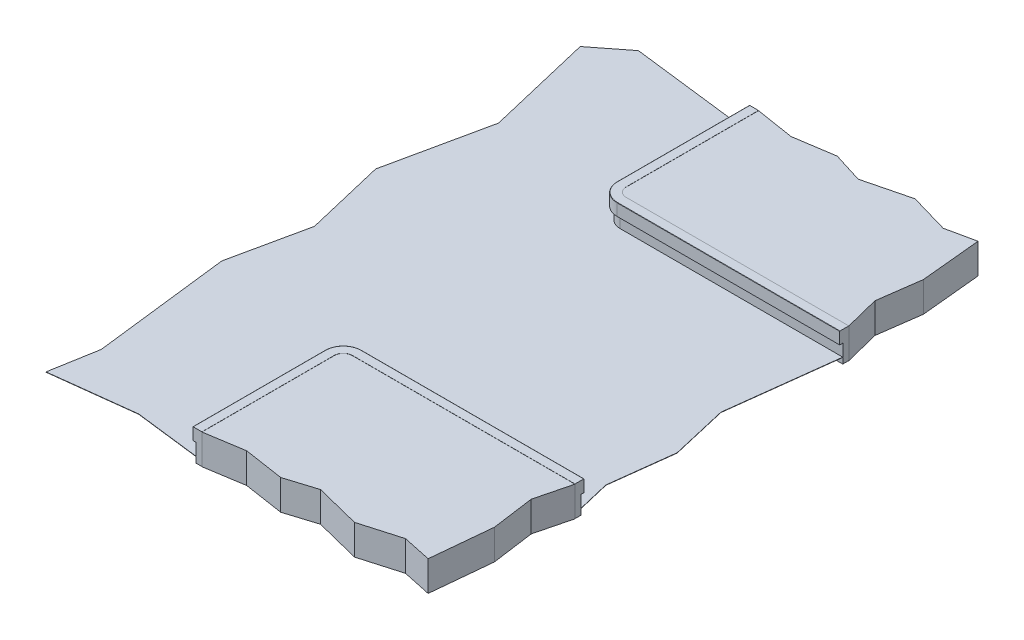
ISO-10303-21;
HEADER;
FILE_DESCRIPTION(('STEP AP214'),'2;1');
FILE_NAME('part.step','',(''),(''),'','','');
FILE_SCHEMA(('AUTOMOTIVE_DESIGN { 1 0 10303 214 1 1 1 1 }'));
ENDSEC;
DATA;
#1=APPLICATION_CONTEXT('core data for automotive mechanical design processes');
#2=APPLICATION_PROTOCOL_DEFINITION('international standard','automotive_design',2000,#1);
#3=PRODUCT_CONTEXT('',#1,'mechanical');
#4=PRODUCT('Part','Part','',(#3));
#5=PRODUCT_RELATED_PRODUCT_CATEGORY('part','',(#4));
#6=PRODUCT_DEFINITION_FORMATION('','',#4);
#7=PRODUCT_DEFINITION_CONTEXT('part definition',#1,'design');
#8=PRODUCT_DEFINITION('design','',#6,#7);
#9=PRODUCT_DEFINITION_SHAPE('','',#8);
#10=(LENGTH_UNIT() NAMED_UNIT(*) SI_UNIT(.MILLI.,.METRE.));
#11=(NAMED_UNIT(*) PLANE_ANGLE_UNIT() SI_UNIT($,.RADIAN.));
#12=(NAMED_UNIT(*) SI_UNIT($,.STERADIAN.) SOLID_ANGLE_UNIT());
#13=UNCERTAINTY_MEASURE_WITH_UNIT(LENGTH_MEASURE(1.E-05),#10,'distance_accuracy_value','');
#14=(GEOMETRIC_REPRESENTATION_CONTEXT(3) GLOBAL_UNCERTAINTY_ASSIGNED_CONTEXT((#13)) GLOBAL_UNIT_ASSIGNED_CONTEXT((#10,
#11,#12)) REPRESENTATION_CONTEXT('',''));
#15=CARTESIAN_POINT('',(0.,0.,0.));
#16=DIRECTION('',(0.,0.,1.));
#17=DIRECTION('',(1.,0.,0.));
#18=AXIS2_PLACEMENT_3D('',#15,#16,#17);
#19=CARTESIAN_POINT('',(-599.999999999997,-400.,4550.));
#20=DIRECTION('',(0.,0.,1.));
#21=DIRECTION('',(1.,0.,0.));
#22=AXIS2_PLACEMENT_3D('',#19,#20,#21);
#23=PLANE('',#22);
#24=DIRECTION('',(0.,1.,0.));
#25=VECTOR('',#24,1.);
#26=CARTESIAN_POINT('',(-599.999999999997,-400.,4550.));
#27=LINE('',#26,#25);
#28=CARTESIAN_POINT('',(-599.999999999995,-5.,4550.));
#29=VERTEX_POINT('',#28);
#30=CARTESIAN_POINT('',(-599.999999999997,0.,4550.));
#31=VERTEX_POINT('',#30);
#32=EDGE_CURVE('E972',#29,#31,#27,.T.);
#33=ORIENTED_EDGE('',*,*,#32,.F.);
#34=DIRECTION('',(-1.,0.,0.));
#35=VECTOR('',#34,1.);
#36=CARTESIAN_POINT('',(6800.,-5.,4550.));
#37=LINE('',#36,#35);
#38=CARTESIAN_POINT('',(6800.,-5.,4550.));
#39=VERTEX_POINT('',#38);
#40=EDGE_CURVE('E511',#39,#29,#37,.T.);
#41=ORIENTED_EDGE('',*,*,#40,.F.);
#42=DIRECTION('',(0.,1.,0.));
#43=VECTOR('',#42,1.);
#44=CARTESIAN_POINT('',(6800.,-400.,4550.));
#45=LINE('',#44,#43);
#46=CARTESIAN_POINT('',(6800.,0.,4550.));
#47=VERTEX_POINT('',#46);
#48=EDGE_CURVE('E971',#39,#47,#45,.T.);
#49=ORIENTED_EDGE('',*,*,#48,.T.);
#50=DIRECTION('',(1.,0.,0.));
#51=VECTOR('',#50,1.);
#52=CARTESIAN_POINT('',(-599.999999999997,0.,4550.));
#53=LINE('',#52,#51);
#54=EDGE_CURVE('E1004',#31,#47,#53,.T.);
#55=ORIENTED_EDGE('',*,*,#54,.F.);
#56=EDGE_LOOP('',(#33,#41,#49,#55));
#57=FACE_BOUND('',#56,.T.);
#58=ADVANCED_FACE('F33',(#57),#23,.T.);
#59=CARTESIAN_POINT('',(-600.,-400.,4850.));
#60=DIRECTION('',(0.,1.,0.));
#61=DIRECTION('',(0.,0.,1.));
#62=AXIS2_PLACEMENT_3D('',#59,#60,#61);
#63=CYLINDRICAL_SURFACE('',#62,300.);
#64=DIRECTION('',(0.,1.,0.));
#65=VECTOR('',#64,1.);
#66=CARTESIAN_POINT('',(-900.,-400.,4850.));
#67=LINE('',#66,#65);
#68=CARTESIAN_POINT('',(-899.999999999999,-5.,4850.));
#69=VERTEX_POINT('',#68);
#70=CARTESIAN_POINT('',(-900.,0.,4850.));
#71=VERTEX_POINT('',#70);
#72=EDGE_CURVE('E974',#69,#71,#67,.T.);
#73=ORIENTED_EDGE('',*,*,#72,.F.);
#74=CARTESIAN_POINT('',(-600.,-5.,4850.));
#75=DIRECTION('',(0.,1.,0.));
#76=DIRECTION('',(0.,0.,-1.));
#77=AXIS2_PLACEMENT_3D('',#74,#75,#76);
#78=CIRCLE('',#77,300.);
#79=EDGE_CURVE('E542',#29,#69,#78,.T.);
#80=ORIENTED_EDGE('',*,*,#79,.F.);
#81=ORIENTED_EDGE('',*,*,#32,.T.);
#82=CARTESIAN_POINT('',(-600.,0.,4850.));
#83=DIRECTION('',(0.,-1.,0.));
#84=DIRECTION('',(0.,0.,1.));
#85=AXIS2_PLACEMENT_3D('',#82,#83,#84);
#86=CIRCLE('',#85,300.);
#87=EDGE_CURVE('E1002',#71,#31,#86,.T.);
#88=ORIENTED_EDGE('',*,*,#87,.F.);
#89=EDGE_LOOP('',(#73,#80,#81,#88));
#90=FACE_BOUND('',#89,.T.);
#91=ADVANCED_FACE('F1059',(#90),#63,.F.);
#92=CARTESIAN_POINT('',(-900.,-400.,4850.));
#93=DIRECTION('',(1.,0.,0.));
#94=DIRECTION('',(0.,0.,-1.));
#95=AXIS2_PLACEMENT_3D('',#92,#93,#94);
#96=PLANE('',#95);
#97=DIRECTION('',(0.,1.,0.));
#98=VECTOR('',#97,1.);
#99=CARTESIAN_POINT('',(-900.,-400.,9250.));
#100=LINE('',#99,#98);
#101=CARTESIAN_POINT('',(-900.,-5.,9250.));
#102=VERTEX_POINT('',#101);
#103=CARTESIAN_POINT('',(-900.,0.,9250.));
#104=VERTEX_POINT('',#103);
#105=EDGE_CURVE('E979',#102,#104,#100,.T.);
#106=ORIENTED_EDGE('',*,*,#105,.F.);
#107=DIRECTION('',(0.,0.,1.));
#108=VECTOR('',#107,1.);
#109=CARTESIAN_POINT('',(-899.999999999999,-5.,4850.));
#110=LINE('',#109,#108);
#111=EDGE_CURVE('E544',#69,#102,#110,.T.);
#112=ORIENTED_EDGE('',*,*,#111,.F.);
#113=ORIENTED_EDGE('',*,*,#72,.T.);
#114=DIRECTION('',(0.,0.,-1.));
#115=VECTOR('',#114,1.);
#116=CARTESIAN_POINT('',(-900.,0.,4850.));
#117=LINE('',#116,#115);
#118=EDGE_CURVE('E998',#104,#71,#117,.T.);
#119=ORIENTED_EDGE('',*,*,#118,.F.);
#120=EDGE_LOOP('',(#106,#112,#113,#119));
#121=FACE_BOUND('',#120,.T.);
#122=ADVANCED_FACE('F1065',(#121),#96,.T.);
#123=CARTESIAN_POINT('',(-1100.,-1000.,4850.));
#124=DIRECTION('',(1.,0.,0.));
#125=DIRECTION('',(0.,0.,-1.));
#126=AXIS2_PLACEMENT_3D('',#123,#124,#125);
#127=PLANE('',#126);
#128=DIRECTION('',(0.,0.,-1.));
#129=VECTOR('',#128,1.);
#130=CARTESIAN_POINT('',(-1100.,-810.,9250.));
#131=LINE('',#130,#129);
#132=CARTESIAN_POINT('',(-1100.,-810.,9250.));
#133=VERTEX_POINT('',#132);
#134=CARTESIAN_POINT('',(-1100.,-810.,4850.));
#135=VERTEX_POINT('',#134);
#136=EDGE_CURVE('E781',#133,#135,#131,.T.);
#137=ORIENTED_EDGE('',*,*,#136,.T.);
#138=DIRECTION('',(0.,1.,0.));
#139=VECTOR('',#138,1.);
#140=CARTESIAN_POINT('',(-1100.,-1000.,4850.));
#141=LINE('',#140,#139);
#142=CARTESIAN_POINT('',(-1100.,-1000.,4850.));
#143=VERTEX_POINT('',#142);
#144=EDGE_CURVE('E1017',#143,#135,#141,.T.);
#145=ORIENTED_EDGE('',*,*,#144,.F.);
#146=DIRECTION('',(0.,0.,-1.));
#147=VECTOR('',#146,1.);
#148=CARTESIAN_POINT('',(-1100.,-1000.,4850.));
#149=LINE('',#148,#147);
#150=CARTESIAN_POINT('',(-1100.,-1000.,9250.));
#151=VERTEX_POINT('',#150);
#152=EDGE_CURVE('E899',#151,#143,#149,.T.);
#153=ORIENTED_EDGE('',*,*,#152,.F.);
#154=DIRECTION('',(0.,1.,0.));
#155=VECTOR('',#154,1.);
#156=CARTESIAN_POINT('',(-1100.,-1000.,9250.));
#157=LINE('',#156,#155);
#158=EDGE_CURVE('E999',#151,#133,#157,.T.);
#159=ORIENTED_EDGE('',*,*,#158,.T.);
#160=EDGE_LOOP('',(#137,#145,#153,#159));
#161=FACE_BOUND('',#160,.T.);
#162=ADVANCED_FACE('F1056',(#161),#127,.F.);
#163=CARTESIAN_POINT('',(-600.,-1000.,4850.));
#164=DIRECTION('',(0.,1.,0.));
#165=DIRECTION('',(0.,0.,1.));
#166=AXIS2_PLACEMENT_3D('',#163,#164,#165);
#167=CYLINDRICAL_SURFACE('',#166,500.);
#168=CARTESIAN_POINT('',(-600.,-810.,4850.));
#169=DIRECTION('',(0.,-1.,0.));
#170=DIRECTION('',(0.,0.,1.));
#171=AXIS2_PLACEMENT_3D('',#168,#169,#170);
#172=CIRCLE('',#171,500.);
#173=CARTESIAN_POINT('',(-599.999999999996,-810.,4350.));
#174=VERTEX_POINT('',#173);
#175=EDGE_CURVE('E784',#135,#174,#172,.T.);
#176=ORIENTED_EDGE('',*,*,#175,.T.);
#177=DIRECTION('',(0.,1.,0.));
#178=VECTOR('',#177,1.);
#179=CARTESIAN_POINT('',(-599.999999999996,-1000.,4350.));
#180=LINE('',#179,#178);
#181=CARTESIAN_POINT('',(-599.999999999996,-1000.,4350.));
#182=VERTEX_POINT('',#181);
#183=EDGE_CURVE('E920',#182,#174,#180,.T.);
#184=ORIENTED_EDGE('',*,*,#183,.F.);
#185=CARTESIAN_POINT('',(-600.,-1000.,4850.));
#186=DIRECTION('',(0.,-1.,0.));
#187=DIRECTION('',(0.,0.,-1.));
#188=AXIS2_PLACEMENT_3D('',#185,#186,#187);
#189=CIRCLE('',#188,500.);
#190=EDGE_CURVE('E901',#143,#182,#189,.T.);
#191=ORIENTED_EDGE('',*,*,#190,.F.);
#192=ORIENTED_EDGE('',*,*,#144,.T.);
#193=EDGE_LOOP('',(#176,#184,#191,#192));
#194=FACE_BOUND('',#193,.T.);
#195=ADVANCED_FACE('F1045',(#194),#167,.T.);
#196=CARTESIAN_POINT('',(6800.,-1000.,4350.));
#197=DIRECTION('',(0.,0.,1.));
#198=DIRECTION('',(1.,0.,0.));
#199=AXIS2_PLACEMENT_3D('',#196,#197,#198);
#200=PLANE('',#199);
#201=DIRECTION('',(1.,0.,0.));
#202=VECTOR('',#201,1.);
#203=CARTESIAN_POINT('',(-599.999999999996,-810.,4350.));
#204=LINE('',#203,#202);
#205=CARTESIAN_POINT('',(6800.,-810.,4350.));
#206=VERTEX_POINT('',#205);
#207=EDGE_CURVE('E787',#174,#206,#204,.T.);
#208=ORIENTED_EDGE('',*,*,#207,.T.);
#209=DIRECTION('',(0.,1.,0.));
#210=VECTOR('',#209,1.);
#211=CARTESIAN_POINT('',(6800.,-1000.,4350.));
#212=LINE('',#211,#210);
#213=CARTESIAN_POINT('',(6800.,-1000.,4350.));
#214=VERTEX_POINT('',#213);
#215=EDGE_CURVE('E927',#214,#206,#212,.T.);
#216=ORIENTED_EDGE('',*,*,#215,.F.);
#217=DIRECTION('',(1.,0.,0.));
#218=VECTOR('',#217,1.);
#219=CARTESIAN_POINT('',(6800.,-1000.,4350.));
#220=LINE('',#219,#218);
#221=EDGE_CURVE('E903',#182,#214,#220,.T.);
#222=ORIENTED_EDGE('',*,*,#221,.F.);
#223=ORIENTED_EDGE('',*,*,#183,.T.);
#224=EDGE_LOOP('',(#208,#216,#222,#223));
#225=FACE_BOUND('',#224,.T.);
#226=ADVANCED_FACE('F1052',(#225),#200,.F.);
#227=CARTESIAN_POINT('',(-600.,-400.,4850.));
#228=DIRECTION('',(0.,1.,0.));
#229=DIRECTION('',(0.,0.,1.));
#230=AXIS2_PLACEMENT_3D('',#227,#228,#229);
#231=PLANE('',#230);
#232=DIRECTION('',(1.,0.,0.));
#233=VECTOR('',#232,1.);
#234=CARTESIAN_POINT('',(6800.,-400.,4350.));
#235=LINE('',#234,#233);
#236=CARTESIAN_POINT('',(-599.999999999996,-400.,4350.));
#237=VERTEX_POINT('',#236);
#238=CARTESIAN_POINT('',(6800.,-400.,4350.));
#239=VERTEX_POINT('',#238);
#240=EDGE_CURVE('E897',#237,#239,#235,.T.);
#241=ORIENTED_EDGE('',*,*,#240,.F.);
#242=CARTESIAN_POINT('',(-600.,-400.,4850.));
#243=DIRECTION('',(0.,-1.,0.));
#244=DIRECTION('',(0.,0.,-1.));
#245=AXIS2_PLACEMENT_3D('',#242,#243,#244);
#246=CIRCLE('',#245,500.);
#247=CARTESIAN_POINT('',(-1100.,-400.,4850.));
#248=VERTEX_POINT('',#247);
#249=EDGE_CURVE('E914',#248,#237,#246,.T.);
#250=ORIENTED_EDGE('',*,*,#249,.F.);
#251=DIRECTION('',(0.,0.,-1.));
#252=VECTOR('',#251,1.);
#253=CARTESIAN_POINT('',(-1100.,-400.,4850.));
#254=LINE('',#253,#252);
#255=CARTESIAN_POINT('',(-1100.,-400.,9250.));
#256=VERTEX_POINT('',#255);
#257=EDGE_CURVE('E917',#256,#248,#254,.T.);
#258=ORIENTED_EDGE('',*,*,#257,.F.);
#259=DIRECTION('',(1.,0.,0.));
#260=VECTOR('',#259,1.);
#261=CARTESIAN_POINT('',(-1200.,-400.,9250.));
#262=LINE('',#261,#260);
#263=CARTESIAN_POINT('',(-1200.,-400.,9250.));
#264=VERTEX_POINT('',#263);
#265=EDGE_CURVE('E988',#264,#256,#262,.T.);
#266=ORIENTED_EDGE('',*,*,#265,.F.);
#267=DIRECTION('',(0.,0.,1.));
#268=VECTOR('',#267,1.);
#269=CARTESIAN_POINT('',(-1200.,-400.,4850.));
#270=LINE('',#269,#268);
#271=CARTESIAN_POINT('',(-1200.,-400.,4850.));
#272=VERTEX_POINT('',#271);
#273=EDGE_CURVE('E1012',#272,#264,#270,.T.);
#274=ORIENTED_EDGE('',*,*,#273,.F.);
#275=CARTESIAN_POINT('',(-600.,-400.,4850.));
#276=DIRECTION('',(0.,1.,0.));
#277=DIRECTION('',(0.,0.,1.));
#278=AXIS2_PLACEMENT_3D('',#275,#276,#277);
#279=CIRCLE('',#278,600.);
#280=CARTESIAN_POINT('',(-599.999999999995,-400.,4250.));
#281=VERTEX_POINT('',#280);
#282=EDGE_CURVE('E1008',#281,#272,#279,.T.);
#283=ORIENTED_EDGE('',*,*,#282,.F.);
#284=DIRECTION('',(-1.,0.,0.));
#285=VECTOR('',#284,1.);
#286=CARTESIAN_POINT('',(-599.999999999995,-400.,4250.));
#287=LINE('',#286,#285);
#288=CARTESIAN_POINT('',(6800.,-400.,4250.));
#289=VERTEX_POINT('',#288);
#290=EDGE_CURVE('E984',#289,#281,#287,.T.);
#291=ORIENTED_EDGE('',*,*,#290,.F.);
#292=DIRECTION('',(0.,0.,-1.));
#293=VECTOR('',#292,1.);
#294=CARTESIAN_POINT('',(6800.,-400.,4250.));
#295=LINE('',#294,#293);
#296=EDGE_CURVE('E985',#239,#289,#295,.T.);
#297=ORIENTED_EDGE('',*,*,#296,.F.);
#298=EDGE_LOOP('',(#241,#250,#258,#266,#274,#283,#291,#297));
#299=FACE_BOUND('',#298,.T.);
#300=ADVANCED_FACE('F1037',(#299),#231,.F.);
#301=CARTESIAN_POINT('',(-600.,-400.,4850.));
#302=DIRECTION('',(0.,1.,0.));
#303=DIRECTION('',(0.,0.,1.));
#304=AXIS2_PLACEMENT_3D('',#301,#302,#303);
#305=CYLINDRICAL_SURFACE('',#304,600.);
#306=DIRECTION('',(0.,1.,0.));
#307=VECTOR('',#306,1.);
#308=CARTESIAN_POINT('',(-1200.,-400.,4850.));
#309=LINE('',#308,#307);
#310=CARTESIAN_POINT('',(-1200.,-10.,4850.));
#311=VERTEX_POINT('',#310);
#312=EDGE_CURVE('E982',#272,#311,#309,.T.);
#313=ORIENTED_EDGE('',*,*,#312,.T.);
#314=CARTESIAN_POINT('',(-600.,-10.,4850.));
#315=DIRECTION('',(0.,1.,0.));
#316=DIRECTION('',(0.,0.,1.));
#317=AXIS2_PLACEMENT_3D('',#314,#315,#316);
#318=CIRCLE('',#317,600.);
#319=CARTESIAN_POINT('',(-599.999999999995,-10.,4250.));
#320=VERTEX_POINT('',#319);
#321=EDGE_CURVE('E11',#311,#320,#318,.F.);
#322=ORIENTED_EDGE('',*,*,#321,.T.);
#323=DIRECTION('',(0.,1.,0.));
#324=VECTOR('',#323,1.);
#325=CARTESIAN_POINT('',(-599.999999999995,-400.,4250.));
#326=LINE('',#325,#324);
#327=EDGE_CURVE('E955',#281,#320,#326,.T.);
#328=ORIENTED_EDGE('',*,*,#327,.F.);
#329=ORIENTED_EDGE('',*,*,#282,.T.);
#330=EDGE_LOOP('',(#313,#322,#328,#329));
#331=FACE_BOUND('',#330,.T.);
#332=ADVANCED_FACE('F1083',(#331),#305,.T.);
#333=CARTESIAN_POINT('',(-599.999999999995,-400.,4250.));
#334=DIRECTION('',(0.,0.,-1.));
#335=DIRECTION('',(-1.,0.,0.));
#336=AXIS2_PLACEMENT_3D('',#333,#334,#335);
#337=PLANE('',#336);
#338=ORIENTED_EDGE('',*,*,#327,.T.);
#339=DIRECTION('',(-1.,0.,0.));
#340=VECTOR('',#339,1.);
#341=CARTESIAN_POINT('',(-599.999999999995,-10.,4250.));
#342=LINE('',#341,#340);
#343=CARTESIAN_POINT('',(6800.,-10.,4250.));
#344=VERTEX_POINT('',#343);
#345=EDGE_CURVE('E946',#320,#344,#342,.F.);
#346=ORIENTED_EDGE('',*,*,#345,.T.);
#347=DIRECTION('',(0.,1.,0.));
#348=VECTOR('',#347,1.);
#349=CARTESIAN_POINT('',(6800.,-400.,4250.));
#350=LINE('',#349,#348);
#351=EDGE_CURVE('E958',#289,#344,#350,.T.);
#352=ORIENTED_EDGE('',*,*,#351,.F.);
#353=ORIENTED_EDGE('',*,*,#290,.T.);
#354=EDGE_LOOP('',(#338,#346,#352,#353));
#355=FACE_BOUND('',#354,.T.);
#356=ADVANCED_FACE('F1086',(#355),#337,.T.);
#357=CARTESIAN_POINT('',(6800.,-400.,4250.));
#358=DIRECTION('',(1.,0.,0.));
#359=DIRECTION('',(0.,0.,-1.));
#360=AXIS2_PLACEMENT_3D('',#357,#358,#359);
#361=PLANE('',#360);
#362=ORIENTED_EDGE('',*,*,#351,.T.);
#363=CARTESIAN_POINT('',(6800.,-10.,4260.));
#364=DIRECTION('',(1.,0.,0.));
#365=DIRECTION('',(0.,0.,-1.));
#366=AXIS2_PLACEMENT_3D('',#363,#364,#365);
#367=CIRCLE('',#366,10.);
#368=CARTESIAN_POINT('',(6800.,0.,4260.));
#369=VERTEX_POINT('',#368);
#370=EDGE_CURVE('E944',#344,#369,#367,.T.);
#371=ORIENTED_EDGE('',*,*,#370,.T.);
#372=DIRECTION('',(0.,0.,-1.));
#373=VECTOR('',#372,1.);
#374=CARTESIAN_POINT('',(6800.,0.,4250.));
#375=LINE('',#374,#373);
#376=EDGE_CURVE('E967',#47,#369,#375,.T.);
#377=ORIENTED_EDGE('',*,*,#376,.F.);
#378=ORIENTED_EDGE('',*,*,#48,.F.);
#379=CARTESIAN_POINT('',(6800.,-1000.,4550.));
#380=VERTEX_POINT('',#379);
#381=EDGE_CURVE('E964',#380,#39,#45,.T.);
#382=ORIENTED_EDGE('',*,*,#381,.F.);
#383=DIRECTION('',(0.,0.,1.));
#384=VECTOR('',#383,1.);
#385=CARTESIAN_POINT('',(6800.,-1000.,4550.));
#386=LINE('',#385,#384);
#387=EDGE_CURVE('E905',#214,#380,#386,.T.);
#388=ORIENTED_EDGE('',*,*,#387,.F.);
#389=ORIENTED_EDGE('',*,*,#215,.T.);
#390=DIRECTION('',(0.,1.,0.));
#391=VECTOR('',#390,1.);
#392=CARTESIAN_POINT('',(6800.,-810.,4350.));
#393=LINE('',#392,#391);
#394=CARTESIAN_POINT('',(6800.,-800.,4350.));
#395=VERTEX_POINT('',#394);
#396=EDGE_CURVE('E871',#206,#395,#393,.T.);
#397=ORIENTED_EDGE('',*,*,#396,.T.);
#398=EDGE_CURVE('E913',#395,#239,#212,.T.);
#399=ORIENTED_EDGE('',*,*,#398,.T.);
#400=ORIENTED_EDGE('',*,*,#296,.T.);
#401=EDGE_LOOP('',(#362,#371,#377,#378,#382,#388,#389,#397,#399,#400));
#402=FACE_BOUND('',#401,.T.);
#403=ADVANCED_FACE('F1070',(#402),#361,.T.);
#404=CARTESIAN_POINT('',(-1200.,-400.,9250.));
#405=DIRECTION('',(0.,0.,1.));
#406=DIRECTION('',(1.,0.,0.));
#407=AXIS2_PLACEMENT_3D('',#404,#405,#406);
#408=PLANE('',#407);
#409=DIRECTION('',(1.,0.,0.));
#410=VECTOR('',#409,1.);
#411=CARTESIAN_POINT('',(-1200.,0.,9250.));
#412=LINE('',#411,#410);
#413=CARTESIAN_POINT('',(-1190.,0.,9250.));
#414=VERTEX_POINT('',#413);
#415=EDGE_CURVE('E996',#414,#104,#412,.T.);
#416=ORIENTED_EDGE('',*,*,#415,.F.);
#417=CARTESIAN_POINT('',(-1190.,-10.,9250.));
#418=DIRECTION('',(0.,0.,1.));
#419=DIRECTION('',(1.,0.,0.));
#420=AXIS2_PLACEMENT_3D('',#417,#418,#419);
#421=CIRCLE('',#420,10.);
#422=CARTESIAN_POINT('',(-1200.,-10.,9250.));
#423=VERTEX_POINT('',#422);
#424=EDGE_CURVE('E942',#414,#423,#421,.T.);
#425=ORIENTED_EDGE('',*,*,#424,.T.);
#426=DIRECTION('',(0.,1.,0.));
#427=VECTOR('',#426,1.);
#428=CARTESIAN_POINT('',(-1200.,-400.,9250.));
#429=LINE('',#428,#427);
#430=EDGE_CURVE('E980',#264,#423,#429,.T.);
#431=ORIENTED_EDGE('',*,*,#430,.F.);
#432=ORIENTED_EDGE('',*,*,#265,.T.);
#433=CARTESIAN_POINT('',(-1100.,-800.,9250.));
#434=VERTEX_POINT('',#433);
#435=EDGE_CURVE('E37',#434,#256,#157,.T.);
#436=ORIENTED_EDGE('',*,*,#435,.F.);
#437=DIRECTION('',(0.,1.,0.));
#438=VECTOR('',#437,1.);
#439=CARTESIAN_POINT('',(-1100.,-810.,9250.));
#440=LINE('',#439,#438);
#441=EDGE_CURVE('E874',#133,#434,#440,.T.);
#442=ORIENTED_EDGE('',*,*,#441,.F.);
#443=ORIENTED_EDGE('',*,*,#158,.F.);
#444=DIRECTION('',(-1.,0.,0.));
#445=VECTOR('',#444,1.);
#446=CARTESIAN_POINT('',(-1100.,-1000.,9250.));
#447=LINE('',#446,#445);
#448=CARTESIAN_POINT('',(-900.,-1000.,9250.));
#449=VERTEX_POINT('',#448);
#450=EDGE_CURVE('E896',#449,#151,#447,.T.);
#451=ORIENTED_EDGE('',*,*,#450,.F.);
#452=EDGE_CURVE('E976',#449,#102,#100,.T.);
#453=ORIENTED_EDGE('',*,*,#452,.T.);
#454=ORIENTED_EDGE('',*,*,#105,.T.);
#455=EDGE_LOOP('',(#416,#425,#431,#432,#436,#442,#443,#451,#453,#454));
#456=FACE_BOUND('',#455,.T.);
#457=ADVANCED_FACE('F1076',(#456),#408,.T.);
#458=CARTESIAN_POINT('',(-1200.,-400.,4850.));
#459=DIRECTION('',(-1.,0.,0.));
#460=DIRECTION('',(0.,0.,1.));
#461=AXIS2_PLACEMENT_3D('',#458,#459,#460);
#462=PLANE('',#461);
#463=ORIENTED_EDGE('',*,*,#430,.T.);
#464=DIRECTION('',(0.,0.,1.));
#465=VECTOR('',#464,1.);
#466=CARTESIAN_POINT('',(-1200.,-10.,4850.));
#467=LINE('',#466,#465);
#468=EDGE_CURVE('E43',#423,#311,#467,.F.);
#469=ORIENTED_EDGE('',*,*,#468,.T.);
#470=ORIENTED_EDGE('',*,*,#312,.F.);
#471=ORIENTED_EDGE('',*,*,#273,.T.);
#472=EDGE_LOOP('',(#463,#469,#470,#471));
#473=FACE_BOUND('',#472,.T.);
#474=ADVANCED_FACE('F1079',(#473),#462,.T.);
#475=CARTESIAN_POINT('',(-600.,0.,4850.));
#476=DIRECTION('',(0.,1.,0.));
#477=DIRECTION('',(0.,0.,1.));
#478=AXIS2_PLACEMENT_3D('',#475,#476,#477);
#479=PLANE('',#478);
#480=ORIENTED_EDGE('',*,*,#376,.T.);
#481=DIRECTION('',(-1.,0.,0.));
#482=VECTOR('',#481,1.);
#483=CARTESIAN_POINT('',(-600.,0.,4260.));
#484=LINE('',#483,#482);
#485=CARTESIAN_POINT('',(-599.999999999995,0.,4260.));
#486=VERTEX_POINT('',#485);
#487=EDGE_CURVE('E948',#369,#486,#484,.T.);
#488=ORIENTED_EDGE('',*,*,#487,.T.);
#489=CARTESIAN_POINT('',(-600.,0.,4850.));
#490=DIRECTION('',(0.,1.,0.));
#491=DIRECTION('',(0.,0.,1.));
#492=AXIS2_PLACEMENT_3D('',#489,#490,#491);
#493=CIRCLE('',#492,590.);
#494=CARTESIAN_POINT('',(-1190.,0.,4850.));
#495=VERTEX_POINT('',#494);
#496=EDGE_CURVE('E933',#486,#495,#493,.T.);
#497=ORIENTED_EDGE('',*,*,#496,.T.);
#498=DIRECTION('',(0.,0.,1.));
#499=VECTOR('',#498,1.);
#500=CARTESIAN_POINT('',(-1190.,0.,4850.));
#501=LINE('',#500,#499);
#502=EDGE_CURVE('E950',#495,#414,#501,.T.);
#503=ORIENTED_EDGE('',*,*,#502,.T.);
#504=ORIENTED_EDGE('',*,*,#415,.T.);
#505=ORIENTED_EDGE('',*,*,#118,.T.);
#506=ORIENTED_EDGE('',*,*,#87,.T.);
#507=ORIENTED_EDGE('',*,*,#54,.T.);
#508=EDGE_LOOP('',(#480,#488,#497,#503,#504,#505,#506,#507));
#509=FACE_BOUND('',#508,.T.);
#510=ADVANCED_FACE('F1053',(#509),#479,.T.);
#511=CARTESIAN_POINT('',(-1100.,-800.,4850.));
#512=VERTEX_POINT('',#511);
#513=EDGE_CURVE('E1019',#512,#248,#141,.T.);
#514=ORIENTED_EDGE('',*,*,#513,.F.);
#515=DIRECTION('',(0.,0.,-1.));
#516=VECTOR('',#515,1.);
#517=CARTESIAN_POINT('',(-1100.,-800.,9250.));
#518=LINE('',#517,#516);
#519=EDGE_CURVE('E842',#434,#512,#518,.T.);
#520=ORIENTED_EDGE('',*,*,#519,.F.);
#521=ORIENTED_EDGE('',*,*,#435,.T.);
#522=ORIENTED_EDGE('',*,*,#257,.T.);
#523=EDGE_LOOP('',(#514,#520,#521,#522));
#524=FACE_BOUND('',#523,.T.);
#525=ADVANCED_FACE('F1043',(#524),#127,.F.);
#526=CARTESIAN_POINT('',(-599.999999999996,-800.,4350.));
#527=VERTEX_POINT('',#526);
#528=EDGE_CURVE('E930',#527,#237,#180,.T.);
#529=ORIENTED_EDGE('',*,*,#528,.F.);
#530=CARTESIAN_POINT('',(-600.,-800.,4850.));
#531=DIRECTION('',(0.,-1.,0.));
#532=DIRECTION('',(0.,0.,1.));
#533=AXIS2_PLACEMENT_3D('',#530,#531,#532);
#534=CIRCLE('',#533,500.);
#535=EDGE_CURVE('E51',#512,#527,#534,.T.);
#536=ORIENTED_EDGE('',*,*,#535,.F.);
#537=ORIENTED_EDGE('',*,*,#513,.T.);
#538=ORIENTED_EDGE('',*,*,#249,.T.);
#539=EDGE_LOOP('',(#529,#536,#537,#538));
#540=FACE_BOUND('',#539,.T.);
#541=ADVANCED_FACE('F1041',(#540),#167,.T.);
#542=ORIENTED_EDGE('',*,*,#398,.F.);
#543=DIRECTION('',(1.,0.,0.));
#544=VECTOR('',#543,1.);
#545=CARTESIAN_POINT('',(-599.999999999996,-800.,4350.));
#546=LINE('',#545,#544);
#547=EDGE_CURVE('E845',#527,#395,#546,.T.);
#548=ORIENTED_EDGE('',*,*,#547,.F.);
#549=ORIENTED_EDGE('',*,*,#528,.T.);
#550=ORIENTED_EDGE('',*,*,#240,.T.);
#551=EDGE_LOOP('',(#542,#548,#549,#550));
#552=FACE_BOUND('',#551,.T.);
#553=ADVANCED_FACE('F1034',(#552),#200,.F.);
#554=CARTESIAN_POINT('',(-600.,-1000.,4850.));
#555=DIRECTION('',(0.,-1.,0.));
#556=DIRECTION('',(0.,0.,-1.));
#557=AXIS2_PLACEMENT_3D('',#554,#555,#556);
#558=PLANE('',#557);
#559=DIRECTION('',(0.,0.,1.));
#560=VECTOR('',#559,1.);
#561=CARTESIAN_POINT('',(-900.,-1000.,9250.));
#562=LINE('',#561,#560);
#563=CARTESIAN_POINT('',(-899.999999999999,-1000.,4850.));
#564=VERTEX_POINT('',#563);
#565=EDGE_CURVE('E490',#564,#449,#562,.T.);
#566=ORIENTED_EDGE('',*,*,#565,.T.);
#567=ORIENTED_EDGE('',*,*,#450,.T.);
#568=ORIENTED_EDGE('',*,*,#152,.T.);
#569=ORIENTED_EDGE('',*,*,#190,.T.);
#570=ORIENTED_EDGE('',*,*,#221,.T.);
#571=ORIENTED_EDGE('',*,*,#387,.T.);
#572=DIRECTION('',(-1.,0.,0.));
#573=VECTOR('',#572,1.);
#574=CARTESIAN_POINT('',(-599.999999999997,-1000.,4550.));
#575=LINE('',#574,#573);
#576=CARTESIAN_POINT('',(-599.999999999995,-1000.,4550.));
#577=VERTEX_POINT('',#576);
#578=EDGE_CURVE('E908',#380,#577,#575,.T.);
#579=ORIENTED_EDGE('',*,*,#578,.T.);
#580=CARTESIAN_POINT('',(-600.,-1000.,4850.));
#581=DIRECTION('',(0.,1.,0.));
#582=DIRECTION('',(0.,0.,-1.));
#583=AXIS2_PLACEMENT_3D('',#580,#581,#582);
#584=CIRCLE('',#583,300.);
#585=EDGE_CURVE('E911',#577,#564,#584,.T.);
#586=ORIENTED_EDGE('',*,*,#585,.T.);
#587=EDGE_LOOP('',(#566,#567,#568,#569,#570,#571,#579,#586));
#588=FACE_BOUND('',#587,.T.);
#589=ADVANCED_FACE('F1050',(#588),#558,.T.);
#590=CARTESIAN_POINT('',(-1190.,-10.,4850.));
#591=DIRECTION('',(0.,0.,1.));
#592=DIRECTION('',(1.,0.,0.));
#593=AXIS2_PLACEMENT_3D('',#590,#591,#592);
#594=CYLINDRICAL_SURFACE('',#593,10.);
#595=ORIENTED_EDGE('',*,*,#424,.F.);
#596=ORIENTED_EDGE('',*,*,#502,.F.);
#597=CARTESIAN_POINT('',(-1190.,-10.,4850.));
#598=DIRECTION('',(0.,0.,-1.));
#599=DIRECTION('',(-1.,0.,0.));
#600=AXIS2_PLACEMENT_3D('',#597,#598,#599);
#601=CIRCLE('',#600,10.);
#602=EDGE_CURVE('E937',#311,#495,#601,.T.);
#603=ORIENTED_EDGE('',*,*,#602,.F.);
#604=ORIENTED_EDGE('',*,*,#468,.F.);
#605=EDGE_LOOP('',(#595,#596,#603,#604));
#606=FACE_BOUND('',#605,.T.);
#607=ADVANCED_FACE('F35',(#606),#594,.T.);
#608=CARTESIAN_POINT('',(-600.,-10.,4850.));
#609=DIRECTION('',(0.,1.,0.));
#610=DIRECTION('',(0.,0.,1.));
#611=AXIS2_PLACEMENT_3D('',#608,#609,#610);
#612=TOROIDAL_SURFACE('',#611,590.,10.);
#613=ORIENTED_EDGE('',*,*,#602,.T.);
#614=ORIENTED_EDGE('',*,*,#496,.F.);
#615=CARTESIAN_POINT('',(-599.999999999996,-10.,4260.));
#616=DIRECTION('',(1.,0.,0.));
#617=DIRECTION('',(0.,0.,-1.));
#618=AXIS2_PLACEMENT_3D('',#615,#616,#617);
#619=CIRCLE('',#618,10.);
#620=EDGE_CURVE('E864',#320,#486,#619,.T.);
#621=ORIENTED_EDGE('',*,*,#620,.F.);
#622=ORIENTED_EDGE('',*,*,#321,.F.);
#623=EDGE_LOOP('',(#613,#614,#621,#622));
#624=FACE_BOUND('',#623,.T.);
#625=ADVANCED_FACE('F1090',(#624),#612,.T.);
#626=CARTESIAN_POINT('',(-600.,-10.,4260.));
#627=DIRECTION('',(-1.,0.,0.));
#628=DIRECTION('',(0.,0.,1.));
#629=AXIS2_PLACEMENT_3D('',#626,#627,#628);
#630=CYLINDRICAL_SURFACE('',#629,10.);
#631=ORIENTED_EDGE('',*,*,#370,.F.);
#632=ORIENTED_EDGE('',*,*,#345,.F.);
#633=ORIENTED_EDGE('',*,*,#620,.T.);
#634=ORIENTED_EDGE('',*,*,#487,.F.);
#635=EDGE_LOOP('',(#631,#632,#633,#634));
#636=FACE_BOUND('',#635,.T.);
#637=ADVANCED_FACE('F1087',(#636),#630,.T.);
#638=CARTESIAN_POINT('',(6800.,-810.,-4350.));
#639=DIRECTION('',(0.992649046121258,0.,0.121028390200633));
#640=DIRECTION('',(0.121028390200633,0.,-0.992649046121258));
#641=AXIS2_PLACEMENT_3D('',#638,#639,#640);
#642=PLANE('',#641);
#643=DIRECTION('',(0.121028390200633,0.,-0.992649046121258));
#644=VECTOR('',#643,1.);
#645=CARTESIAN_POINT('',(6800.,-800.,-4350.));
#646=LINE('',#645,#644);
#647=CARTESIAN_POINT('',(6359.7234353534,-800.,-738.945509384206));
#648=VERTEX_POINT('',#647);
#649=CARTESIAN_POINT('',(6800.,-800.,-4350.));
#650=VERTEX_POINT('',#649);
#651=EDGE_CURVE('E856',#648,#650,#646,.T.);
#652=ORIENTED_EDGE('',*,*,#651,.F.);
#653=DIRECTION('',(0.,1.,0.));
#654=VECTOR('',#653,1.);
#655=CARTESIAN_POINT('',(6359.7234353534,-810.,-738.945509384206));
#656=LINE('',#655,#654);
#657=CARTESIAN_POINT('',(6359.7234353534,-810.,-738.945509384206));
#658=VERTEX_POINT('',#657);
#659=EDGE_CURVE('E865',#658,#648,#656,.T.);
#660=ORIENTED_EDGE('',*,*,#659,.F.);
#661=DIRECTION('',(0.121028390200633,0.,-0.992649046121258));
#662=VECTOR('',#661,1.);
#663=CARTESIAN_POINT('',(6800.,-810.,-4350.));
#664=LINE('',#663,#662);
#665=CARTESIAN_POINT('',(6800.,-810.,-4350.));
#666=VERTEX_POINT('',#665);
#667=EDGE_CURVE('E799',#658,#666,#664,.T.);
#668=ORIENTED_EDGE('',*,*,#667,.T.);
#669=DIRECTION('',(0.,1.,0.));
#670=VECTOR('',#669,1.);
#671=CARTESIAN_POINT('',(6800.,-810.,-4350.));
#672=LINE('',#671,#670);
#673=EDGE_CURVE('E861',#666,#650,#672,.T.);
#674=ORIENTED_EDGE('',*,*,#673,.T.);
#675=EDGE_LOOP('',(#652,#660,#668,#674));
#676=FACE_BOUND('',#675,.T.);
#677=ADVANCED_FACE('F1089',(#676),#642,.T.);
#678=CARTESIAN_POINT('',(6359.7234353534,-810.,-738.945509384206));
#679=DIRECTION('',(0.974008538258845,0.,-0.226511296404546));
#680=DIRECTION('',(-0.226511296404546,0.,-0.974008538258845));
#681=AXIS2_PLACEMENT_3D('',#678,#679,#680);
#682=PLANE('',#681);
#683=DIRECTION('',(-0.226511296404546,0.,-0.974008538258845));
#684=VECTOR('',#683,1.);
#685=CARTESIAN_POINT('',(6359.7234353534,-800.,-738.945509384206));
#686=LINE('',#685,#684);
#687=CARTESIAN_POINT('',(6800.,-800.,1154.26308536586));
#688=VERTEX_POINT('',#687);
#689=EDGE_CURVE('E853',#688,#648,#686,.T.);
#690=ORIENTED_EDGE('',*,*,#689,.F.);
#691=DIRECTION('',(0.,1.,0.));
#692=VECTOR('',#691,1.);
#693=CARTESIAN_POINT('',(6800.,-810.,1154.26308536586));
#694=LINE('',#693,#692);
#695=CARTESIAN_POINT('',(6800.,-810.,1154.26308536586));
#696=VERTEX_POINT('',#695);
#697=EDGE_CURVE('E867',#696,#688,#694,.T.);
#698=ORIENTED_EDGE('',*,*,#697,.F.);
#699=DIRECTION('',(-0.226511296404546,0.,-0.974008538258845));
#700=VECTOR('',#699,1.);
#701=CARTESIAN_POINT('',(6359.7234353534,-810.,-738.945509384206));
#702=LINE('',#701,#700);
#703=EDGE_CURVE('E796',#696,#658,#702,.T.);
#704=ORIENTED_EDGE('',*,*,#703,.T.);
#705=ORIENTED_EDGE('',*,*,#659,.T.);
#706=EDGE_LOOP('',(#690,#698,#704,#705));
#707=FACE_BOUND('',#706,.T.);
#708=ADVANCED_FACE('F1321',(#707),#682,.T.);
#709=CARTESIAN_POINT('',(6800.,-810.,1154.26308536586));
#710=DIRECTION('',(0.992649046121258,0.,0.121028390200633));
#711=DIRECTION('',(0.121028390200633,0.,-0.992649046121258));
#712=AXIS2_PLACEMENT_3D('',#709,#710,#711);
#713=PLANE('',#712);
#714=DIRECTION('',(0.121028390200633,0.,-0.992649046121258));
#715=VECTOR('',#714,1.);
#716=CARTESIAN_POINT('',(6800.,-800.,1154.26308536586));
#717=LINE('',#716,#715);
#718=CARTESIAN_POINT('',(6542.43852880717,-800.,3266.72734497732));
#719=VERTEX_POINT('',#718);
#720=EDGE_CURVE('E850',#719,#688,#717,.T.);
#721=ORIENTED_EDGE('',*,*,#720,.F.);
#722=DIRECTION('',(0.,1.,0.));
#723=VECTOR('',#722,1.);
#724=CARTESIAN_POINT('',(6542.43852880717,-810.,3266.72734497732));
#725=LINE('',#724,#723);
#726=CARTESIAN_POINT('',(6542.43852880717,-810.,3266.72734497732));
#727=VERTEX_POINT('',#726);
#728=EDGE_CURVE('E869',#727,#719,#725,.T.);
#729=ORIENTED_EDGE('',*,*,#728,.F.);
#730=DIRECTION('',(0.121028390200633,0.,-0.992649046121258));
#731=VECTOR('',#730,1.);
#732=CARTESIAN_POINT('',(6800.,-810.,1154.26308536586));
#733=LINE('',#732,#731);
#734=EDGE_CURVE('E793',#727,#696,#733,.T.);
#735=ORIENTED_EDGE('',*,*,#734,.T.);
#736=ORIENTED_EDGE('',*,*,#697,.T.);
#737=EDGE_LOOP('',(#721,#729,#735,#736));
#738=FACE_BOUND('',#737,.T.);
#739=ADVANCED_FACE('F1324',(#738),#713,.T.);
#740=CARTESIAN_POINT('',(6542.43852880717,-810.,3266.72734497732));
#741=DIRECTION('',(0.972879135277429,0.,-0.231314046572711));
#742=DIRECTION('',(-0.231314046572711,0.,-0.972879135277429));
#743=AXIS2_PLACEMENT_3D('',#740,#741,#742);
#744=PLANE('',#743);
#745=DIRECTION('',(-0.231314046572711,0.,-0.972879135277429));
#746=VECTOR('',#745,1.);
#747=CARTESIAN_POINT('',(6542.43852880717,-800.,3266.72734497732));
#748=LINE('',#747,#746);
#749=EDGE_CURVE('E847',#395,#719,#748,.T.);
#750=ORIENTED_EDGE('',*,*,#749,.F.);
#751=ORIENTED_EDGE('',*,*,#396,.F.);
#752=DIRECTION('',(-0.231314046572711,0.,-0.972879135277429));
#753=VECTOR('',#752,1.);
#754=CARTESIAN_POINT('',(6542.43852880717,-810.,3266.72734497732));
#755=LINE('',#754,#753);
#756=EDGE_CURVE('E790',#206,#727,#755,.T.);
#757=ORIENTED_EDGE('',*,*,#756,.T.);
#758=ORIENTED_EDGE('',*,*,#728,.T.);
#759=EDGE_LOOP('',(#750,#751,#757,#758));
#760=FACE_BOUND('',#759,.T.);
#761=ADVANCED_FACE('F1327',(#760),#744,.T.);
#762=CARTESIAN_POINT('',(-1100.,-810.,9250.));
#763=DIRECTION('',(-0.121028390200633,0.,0.992649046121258));
#764=DIRECTION('',(0.992649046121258,0.,0.121028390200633));
#765=AXIS2_PLACEMENT_3D('',#762,#763,#764);
#766=PLANE('',#765);
#767=DIRECTION('',(0.992649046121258,0.,0.121028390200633));
#768=VECTOR('',#767,1.);
#769=CARTESIAN_POINT('',(-1100.,-800.,9250.));
#770=LINE('',#769,#768);
#771=CARTESIAN_POINT('',(-3265.97904098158,-800.,8985.91375767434));
#772=VERTEX_POINT('',#771);
#773=EDGE_CURVE('E839',#772,#434,#770,.T.);
#774=ORIENTED_EDGE('',*,*,#773,.F.);
#775=DIRECTION('',(0.,1.,0.));
#776=VECTOR('',#775,1.);
#777=CARTESIAN_POINT('',(-3265.97904098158,-810.,8985.91375767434));
#778=LINE('',#777,#776);
#779=CARTESIAN_POINT('',(-3265.97904098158,-810.,8985.91375767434));
#780=VERTEX_POINT('',#779);
#781=EDGE_CURVE('E876',#780,#772,#778,.T.);
#782=ORIENTED_EDGE('',*,*,#781,.F.);
#783=DIRECTION('',(0.992649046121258,0.,0.121028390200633));
#784=VECTOR('',#783,1.);
#785=CARTESIAN_POINT('',(-1100.,-810.,9250.));
#786=LINE('',#785,#784);
#787=EDGE_CURVE('E778',#780,#133,#786,.T.);
#788=ORIENTED_EDGE('',*,*,#787,.T.);
#789=ORIENTED_EDGE('',*,*,#441,.T.);
#790=EDGE_LOOP('',(#774,#782,#788,#789));
#791=FACE_BOUND('',#790,.T.);
#792=ADVANCED_FACE('F1114',(#791),#766,.T.);
#793=CARTESIAN_POINT('',(-3265.97904098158,-810.,8985.91375767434));
#794=DIRECTION('',(0.118854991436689,0.,0.992911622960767));
#795=DIRECTION('',(0.992911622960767,0.,-0.118854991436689));
#796=AXIS2_PLACEMENT_3D('',#793,#794,#795);
#797=PLANE('',#796);
#798=DIRECTION('',(0.992911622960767,0.,-0.118854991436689));
#799=VECTOR('',#798,1.);
#800=CARTESIAN_POINT('',(-3265.97904098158,-800.,8985.91375767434));
#801=LINE('',#800,#799);
#802=CARTESIAN_POINT('',(-6016.94337263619,-800.,9315.2138026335));
#803=VERTEX_POINT('',#802);
#804=EDGE_CURVE('E836',#803,#772,#801,.T.);
#805=ORIENTED_EDGE('',*,*,#804,.F.);
#806=DIRECTION('',(0.,1.,0.));
#807=VECTOR('',#806,1.);
#808=CARTESIAN_POINT('',(-6016.94337263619,-810.,9315.2138026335));
#809=LINE('',#808,#807);
#810=CARTESIAN_POINT('',(-6016.94337263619,-810.,9315.2138026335));
#811=VERTEX_POINT('',#810);
#812=EDGE_CURVE('E878',#811,#803,#809,.T.);
#813=ORIENTED_EDGE('',*,*,#812,.F.);
#814=DIRECTION('',(0.992911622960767,0.,-0.118854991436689));
#815=VECTOR('',#814,1.);
#816=CARTESIAN_POINT('',(-3265.97904098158,-810.,8985.91375767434));
#817=LINE('',#816,#815);
#818=EDGE_CURVE('E775',#811,#780,#817,.T.);
#819=ORIENTED_EDGE('',*,*,#818,.T.);
#820=ORIENTED_EDGE('',*,*,#781,.T.);
#821=EDGE_LOOP('',(#805,#813,#819,#820));
#822=FACE_BOUND('',#821,.T.);
#823=ADVANCED_FACE('F1122',(#822),#797,.T.);
#824=CARTESIAN_POINT('',(-6016.94337263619,-810.,9315.2138026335));
#825=DIRECTION('',(-0.985202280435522,0.,-0.171395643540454));
#826=DIRECTION('',(-0.171395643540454,0.,0.985202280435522));
#827=AXIS2_PLACEMENT_3D('',#824,#825,#826);
#828=PLANE('',#827);
#829=DIRECTION('',(-0.171395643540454,0.,0.985202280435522));
#830=VECTOR('',#829,1.);
#831=CARTESIAN_POINT('',(-6016.94337263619,-800.,9315.2138026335));
#832=LINE('',#831,#830);
#833=CARTESIAN_POINT('',(-5744.65219451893,-800.,7750.05214459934));
#834=VERTEX_POINT('',#833);
#835=EDGE_CURVE('E833',#834,#803,#832,.T.);
#836=ORIENTED_EDGE('',*,*,#835,.F.);
#837=DIRECTION('',(0.,1.,0.));
#838=VECTOR('',#837,1.);
#839=CARTESIAN_POINT('',(-5744.65219451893,-810.,7750.05214459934));
#840=LINE('',#839,#838);
#841=CARTESIAN_POINT('',(-5744.65219451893,-810.,7750.05214459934));
#842=VERTEX_POINT('',#841);
#843=EDGE_CURVE('E880',#842,#834,#840,.T.);
#844=ORIENTED_EDGE('',*,*,#843,.F.);
#845=DIRECTION('',(-0.171395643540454,0.,0.985202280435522));
#846=VECTOR('',#845,1.);
#847=CARTESIAN_POINT('',(-6016.94337263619,-810.,9315.2138026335));
#848=LINE('',#847,#846);
#849=EDGE_CURVE('E772',#842,#811,#848,.T.);
#850=ORIENTED_EDGE('',*,*,#849,.T.);
#851=ORIENTED_EDGE('',*,*,#812,.T.);
#852=EDGE_LOOP('',(#836,#844,#850,#851));
#853=FACE_BOUND('',#852,.T.);
#854=ADVANCED_FACE('F1125',(#853),#828,.T.);
#855=CARTESIAN_POINT('',(-6289.23455075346,-810.,3200.6247740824));
#856=DIRECTION('',(-0.992911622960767,0.,0.118854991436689));
#857=DIRECTION('',(0.118854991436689,0.,0.992911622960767));
#858=AXIS2_PLACEMENT_3D('',#855,#856,#857);
#859=PLANE('',#858);
#860=DIRECTION('',(0.118854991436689,0.,0.992911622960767));
#861=VECTOR('',#860,1.);
#862=CARTESIAN_POINT('',(-6289.23455075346,-800.,3200.6247740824));
#863=LINE('',#862,#861);
#864=CARTESIAN_POINT('',(-6289.23455075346,-800.,3200.6247740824));
#865=VERTEX_POINT('',#864);
#866=EDGE_CURVE('E830',#865,#834,#863,.T.);
#867=ORIENTED_EDGE('',*,*,#866,.F.);
#868=DIRECTION('',(0.,1.,0.));
#869=VECTOR('',#868,1.);
#870=CARTESIAN_POINT('',(-6289.23455075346,-810.,3200.6247740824));
#871=LINE('',#870,#869);
#872=CARTESIAN_POINT('',(-6289.23455075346,-810.,3200.6247740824));
#873=VERTEX_POINT('',#872);
#874=EDGE_CURVE('E882',#873,#865,#871,.T.);
#875=ORIENTED_EDGE('',*,*,#874,.F.);
#876=DIRECTION('',(0.118854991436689,0.,0.992911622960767));
#877=VECTOR('',#876,1.);
#878=CARTESIAN_POINT('',(-6289.23455075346,-810.,3200.6247740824));
#879=LINE('',#878,#877);
#880=EDGE_CURVE('E769',#873,#842,#879,.T.);
#881=ORIENTED_EDGE('',*,*,#880,.T.);
#882=ORIENTED_EDGE('',*,*,#843,.T.);
#883=EDGE_LOOP('',(#867,#875,#881,#882));
#884=FACE_BOUND('',#883,.T.);
#885=ADVANCED_FACE('F1130',(#884),#859,.T.);
#886=CARTESIAN_POINT('',(-5744.65219451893,-810.,663.151786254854));
#887=DIRECTION('',(-0.977736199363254,0.,-0.209837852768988));
#888=DIRECTION('',(-0.209837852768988,0.,0.977736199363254));
#889=AXIS2_PLACEMENT_3D('',#886,#887,#888);
#890=PLANE('',#889);
#891=DIRECTION('',(-0.209837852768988,0.,0.977736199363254));
#892=VECTOR('',#891,1.);
#893=CARTESIAN_POINT('',(-5744.65219451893,-800.,663.151786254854));
#894=LINE('',#893,#892);
#895=CARTESIAN_POINT('',(-5744.65219451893,-800.,663.151786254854));
#896=VERTEX_POINT('',#895);
#897=EDGE_CURVE('E827',#896,#865,#894,.T.);
#898=ORIENTED_EDGE('',*,*,#897,.F.);
#899=DIRECTION('',(0.,1.,0.));
#900=VECTOR('',#899,1.);
#901=CARTESIAN_POINT('',(-5744.65219451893,-810.,663.151786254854));
#902=LINE('',#901,#900);
#903=CARTESIAN_POINT('',(-5744.65219451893,-810.,663.151786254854));
#904=VERTEX_POINT('',#903);
#905=EDGE_CURVE('E884',#904,#896,#902,.T.);
#906=ORIENTED_EDGE('',*,*,#905,.F.);
#907=DIRECTION('',(-0.209837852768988,0.,0.977736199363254));
#908=VECTOR('',#907,1.);
#909=CARTESIAN_POINT('',(-5744.65219451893,-810.,663.151786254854));
#910=LINE('',#909,#908);
#911=EDGE_CURVE('E766',#904,#873,#910,.T.);
#912=ORIENTED_EDGE('',*,*,#911,.T.);
#913=ORIENTED_EDGE('',*,*,#874,.T.);
#914=EDGE_LOOP('',(#898,#906,#912,#913));
#915=FACE_BOUND('',#914,.T.);
#916=ADVANCED_FACE('F1133',(#915),#890,.T.);
#917=CARTESIAN_POINT('',(-6379.10934490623,-810.,-2005.29888928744));
#918=DIRECTION('',(-0.972879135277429,0.,0.231314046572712));
#919=DIRECTION('',(0.231314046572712,0.,0.972879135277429));
#920=AXIS2_PLACEMENT_3D('',#917,#918,#919);
#921=PLANE('',#920);
#922=DIRECTION('',(0.231314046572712,0.,0.972879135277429));
#923=VECTOR('',#922,1.);
#924=CARTESIAN_POINT('',(-6379.10934490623,-800.,-2005.29888928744));
#925=LINE('',#924,#923);
#926=CARTESIAN_POINT('',(-6379.10934490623,-800.,-2005.29888928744));
#927=VERTEX_POINT('',#926);
#928=EDGE_CURVE('E824',#927,#896,#925,.T.);
#929=ORIENTED_EDGE('',*,*,#928,.F.);
#930=DIRECTION('',(0.,1.,0.));
#931=VECTOR('',#930,1.);
#932=CARTESIAN_POINT('',(-6379.10934490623,-810.,-2005.29888928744));
#933=LINE('',#932,#931);
#934=CARTESIAN_POINT('',(-6379.10934490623,-810.,-2005.29888928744));
#935=VERTEX_POINT('',#934);
#936=EDGE_CURVE('E886',#935,#927,#933,.T.);
#937=ORIENTED_EDGE('',*,*,#936,.F.);
#938=DIRECTION('',(0.231314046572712,0.,0.972879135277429));
#939=VECTOR('',#938,1.);
#940=CARTESIAN_POINT('',(-6379.10934490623,-810.,-2005.29888928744));
#941=LINE('',#940,#939);
#942=EDGE_CURVE('E763',#935,#904,#941,.T.);
#943=ORIENTED_EDGE('',*,*,#942,.T.);
#944=ORIENTED_EDGE('',*,*,#905,.T.);
#945=EDGE_LOOP('',(#929,#937,#943,#944));
#946=FACE_BOUND('',#945,.T.);
#947=ADVANCED_FACE('F1138',(#946),#921,.T.);
#948=CARTESIAN_POINT('',(-5657.72789923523,-810.,-5366.56447447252));
#949=DIRECTION('',(-0.977736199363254,0.,-0.209837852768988));
#950=DIRECTION('',(-0.209837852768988,0.,0.977736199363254));
#951=AXIS2_PLACEMENT_3D('',#948,#949,#950);
#952=PLANE('',#951);
#953=DIRECTION('',(-0.209837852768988,0.,0.977736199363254));
#954=VECTOR('',#953,1.);
#955=CARTESIAN_POINT('',(-5657.72789923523,-800.,-5366.56447447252));
#956=LINE('',#955,#954);
#957=CARTESIAN_POINT('',(-5657.72789923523,-800.,-5366.56447447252));
#958=VERTEX_POINT('',#957);
#959=EDGE_CURVE('E821',#958,#927,#956,.T.);
#960=ORIENTED_EDGE('',*,*,#959,.F.);
#961=DIRECTION('',(0.,1.,0.));
#962=VECTOR('',#961,1.);
#963=CARTESIAN_POINT('',(-5657.72789923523,-810.,-5366.56447447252));
#964=LINE('',#963,#962);
#965=CARTESIAN_POINT('',(-5657.72789923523,-810.,-5366.56447447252));
#966=VERTEX_POINT('',#965);
#967=EDGE_CURVE('E888',#966,#958,#964,.T.);
#968=ORIENTED_EDGE('',*,*,#967,.F.);
#969=DIRECTION('',(-0.209837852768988,0.,0.977736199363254));
#970=VECTOR('',#969,1.);
#971=CARTESIAN_POINT('',(-5657.72789923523,-810.,-5366.56447447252));
#972=LINE('',#971,#970);
#973=EDGE_CURVE('E760',#966,#935,#972,.T.);
#974=ORIENTED_EDGE('',*,*,#973,.T.);
#975=ORIENTED_EDGE('',*,*,#936,.T.);
#976=EDGE_LOOP('',(#960,#968,#974,#975));
#977=FACE_BOUND('',#976,.T.);
#978=ADVANCED_FACE('F1141',(#977),#952,.T.);
#979=CARTESIAN_POINT('',(-6504.37957905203,-810.,-8927.47988944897));
#980=DIRECTION('',(-0.972879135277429,0.,0.231314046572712));
#981=DIRECTION('',(0.231314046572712,0.,0.972879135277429));
#982=AXIS2_PLACEMENT_3D('',#979,#980,#981);
#983=PLANE('',#982);
#984=DIRECTION('',(0.231314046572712,0.,0.972879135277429));
#985=VECTOR('',#984,1.);
#986=CARTESIAN_POINT('',(-6504.37957905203,-800.,-8927.47988944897));
#987=LINE('',#986,#985);
#988=CARTESIAN_POINT('',(-6504.37957905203,-800.,-8927.47988944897));
#989=VERTEX_POINT('',#988);
#990=EDGE_CURVE('E818',#989,#958,#987,.T.);
#991=ORIENTED_EDGE('',*,*,#990,.F.);
#992=DIRECTION('',(0.,1.,0.));
#993=VECTOR('',#992,1.);
#994=CARTESIAN_POINT('',(-6504.37957905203,-810.,-8927.47988944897));
#995=LINE('',#994,#993);
#996=CARTESIAN_POINT('',(-6504.37957905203,-810.,-8927.47988944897));
#997=VERTEX_POINT('',#996);
#998=EDGE_CURVE('E890',#997,#989,#995,.T.);
#999=ORIENTED_EDGE('',*,*,#998,.F.);
#1000=DIRECTION('',(0.231314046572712,0.,0.972879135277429));
#1001=VECTOR('',#1000,1.);
#1002=CARTESIAN_POINT('',(-6504.37957905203,-810.,-8927.47988944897));
#1003=LINE('',#1002,#1001);
#1004=EDGE_CURVE('E757',#997,#966,#1003,.T.);
#1005=ORIENTED_EDGE('',*,*,#1004,.T.);
#1006=ORIENTED_EDGE('',*,*,#967,.T.);
#1007=EDGE_LOOP('',(#991,#999,#1005,#1006));
#1008=FACE_BOUND('',#1007,.T.);
#1009=ADVANCED_FACE('F1146',(#1008),#983,.T.);
#1010=CARTESIAN_POINT('',(-5419.39866951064,-810.,-9776.64118264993));
#1011=DIRECTION('',(-0.616328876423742,0.,-0.787488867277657));
#1012=DIRECTION('',(-0.787488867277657,0.,0.616328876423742));
#1013=AXIS2_PLACEMENT_3D('',#1010,#1011,#1012);
#1014=PLANE('',#1013);
#1015=DIRECTION('',(-0.787488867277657,0.,0.616328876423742));
#1016=VECTOR('',#1015,1.);
#1017=CARTESIAN_POINT('',(-5419.39866951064,-800.,-9776.64118264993));
#1018=LINE('',#1017,#1016);
#1019=CARTESIAN_POINT('',(-5419.39866951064,-800.,-9776.64118264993));
#1020=VERTEX_POINT('',#1019);
#1021=EDGE_CURVE('E815',#1020,#989,#1018,.T.);
#1022=ORIENTED_EDGE('',*,*,#1021,.F.);
#1023=DIRECTION('',(0.,1.,0.));
#1024=VECTOR('',#1023,1.);
#1025=CARTESIAN_POINT('',(-5419.39866951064,-810.,-9776.64118264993));
#1026=LINE('',#1025,#1024);
#1027=CARTESIAN_POINT('',(-5419.39866951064,-810.,-9776.64118264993));
#1028=VERTEX_POINT('',#1027);
#1029=EDGE_CURVE('E892',#1028,#1020,#1026,.T.);
#1030=ORIENTED_EDGE('',*,*,#1029,.F.);
#1031=DIRECTION('',(-0.787488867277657,0.,0.616328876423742));
#1032=VECTOR('',#1031,1.);
#1033=CARTESIAN_POINT('',(-5419.39866951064,-810.,-9776.64118264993));
#1034=LINE('',#1033,#1032);
#1035=EDGE_CURVE('E754',#1028,#997,#1034,.T.);
#1036=ORIENTED_EDGE('',*,*,#1035,.T.);
#1037=ORIENTED_EDGE('',*,*,#998,.T.);
#1038=EDGE_LOOP('',(#1022,#1030,#1036,#1037));
#1039=FACE_BOUND('',#1038,.T.);
#1040=ADVANCED_FACE('F1149',(#1039),#1014,.T.);
#1041=CARTESIAN_POINT('',(-1100.,-810.,-9250.));
#1042=DIRECTION('',(0.121028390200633,0.,-0.992649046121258));
#1043=DIRECTION('',(-0.992649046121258,0.,-0.121028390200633));
#1044=AXIS2_PLACEMENT_3D('',#1041,#1042,#1043);
#1045=PLANE('',#1044);
#1046=DIRECTION('',(-0.992649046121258,0.,-0.121028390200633));
#1047=VECTOR('',#1046,1.);
#1048=CARTESIAN_POINT('',(-1100.,-800.,-9250.));
#1049=LINE('',#1048,#1047);
#1050=CARTESIAN_POINT('',(-1100.,-800.,-9250.));
#1051=VERTEX_POINT('',#1050);
#1052=EDGE_CURVE('E812',#1051,#1020,#1049,.T.);
#1053=ORIENTED_EDGE('',*,*,#1052,.F.);
#1054=DIRECTION('',(0.,1.,0.));
#1055=VECTOR('',#1054,1.);
#1056=CARTESIAN_POINT('',(-1100.,-810.,-9250.));
#1057=LINE('',#1056,#1055);
#1058=CARTESIAN_POINT('',(-1100.,-810.,-9250.));
#1059=VERTEX_POINT('',#1058);
#1060=EDGE_CURVE('E804',#1059,#1051,#1057,.T.);
#1061=ORIENTED_EDGE('',*,*,#1060,.F.);
#1062=DIRECTION('',(-0.992649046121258,0.,-0.121028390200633));
#1063=VECTOR('',#1062,1.);
#1064=CARTESIAN_POINT('',(-1100.,-810.,-9250.));
#1065=LINE('',#1064,#1063);
#1066=EDGE_CURVE('E751',#1059,#1028,#1065,.T.);
#1067=ORIENTED_EDGE('',*,*,#1066,.T.);
#1068=ORIENTED_EDGE('',*,*,#1029,.T.);
#1069=EDGE_LOOP('',(#1053,#1061,#1067,#1068));
#1070=FACE_BOUND('',#1069,.T.);
#1071=ADVANCED_FACE('F1155',(#1070),#1045,.T.);
#1072=CARTESIAN_POINT('',(-600.,-810.,-4850.));
#1073=DIRECTION('',(0.,1.,0.));
#1074=DIRECTION('',(0.,0.,1.));
#1075=AXIS2_PLACEMENT_3D('',#1072,#1073,#1074);
#1076=PLANE('',#1075);
#1077=CARTESIAN_POINT('',(-600.,-810.,-4850.));
#1078=DIRECTION('',(0.,-1.,0.));
#1079=DIRECTION('',(0.,0.,1.));
#1080=AXIS2_PLACEMENT_3D('',#1077,#1078,#1079);
#1081=CIRCLE('',#1080,500.);
#1082=CARTESIAN_POINT('',(-599.999999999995,-810.,-4350.));
#1083=VERTEX_POINT('',#1082);
#1084=CARTESIAN_POINT('',(-1100.,-810.,-4850.));
#1085=VERTEX_POINT('',#1084);
#1086=EDGE_CURVE('E746',#1083,#1085,#1081,.T.);
#1087=ORIENTED_EDGE('',*,*,#1086,.F.);
#1088=DIRECTION('',(-1.,0.,0.));
#1089=VECTOR('',#1088,1.);
#1090=CARTESIAN_POINT('',(6800.,-810.,-4350.));
#1091=LINE('',#1090,#1089);
#1092=EDGE_CURVE('E802',#666,#1083,#1091,.T.);
#1093=ORIENTED_EDGE('',*,*,#1092,.F.);
#1094=ORIENTED_EDGE('',*,*,#667,.F.);
#1095=ORIENTED_EDGE('',*,*,#703,.F.);
#1096=ORIENTED_EDGE('',*,*,#734,.F.);
#1097=ORIENTED_EDGE('',*,*,#756,.F.);
#1098=ORIENTED_EDGE('',*,*,#207,.F.);
#1099=ORIENTED_EDGE('',*,*,#175,.F.);
#1100=ORIENTED_EDGE('',*,*,#136,.F.);
#1101=ORIENTED_EDGE('',*,*,#787,.F.);
#1102=ORIENTED_EDGE('',*,*,#818,.F.);
#1103=ORIENTED_EDGE('',*,*,#849,.F.);
#1104=ORIENTED_EDGE('',*,*,#880,.F.);
#1105=ORIENTED_EDGE('',*,*,#911,.F.);
#1106=ORIENTED_EDGE('',*,*,#942,.F.);
#1107=ORIENTED_EDGE('',*,*,#973,.F.);
#1108=ORIENTED_EDGE('',*,*,#1004,.F.);
#1109=ORIENTED_EDGE('',*,*,#1035,.F.);
#1110=ORIENTED_EDGE('',*,*,#1066,.F.);
#1111=DIRECTION('',(0.,0.,-1.));
#1112=VECTOR('',#1111,1.);
#1113=CARTESIAN_POINT('',(-1100.,-810.,-4850.));
#1114=LINE('',#1113,#1112);
#1115=EDGE_CURVE('E748',#1085,#1059,#1114,.T.);
#1116=ORIENTED_EDGE('',*,*,#1115,.F.);
#1117=EDGE_LOOP('',(#1087,#1093,#1094,#1095,#1096,#1097,#1098,#1099,#1100,#1101,#1102,#1103,
#1104,#1105,#1106,#1107,#1108,#1109,#1110,#1116));
#1118=FACE_BOUND('',#1117,.T.);
#1119=ADVANCED_FACE('F1119',(#1118),#1076,.F.);
#1120=CARTESIAN_POINT('',(-600.,-800.,-4850.));
#1121=DIRECTION('',(0.,1.,0.));
#1122=DIRECTION('',(0.,0.,1.));
#1123=AXIS2_PLACEMENT_3D('',#1120,#1121,#1122);
#1124=PLANE('',#1123);
#1125=CARTESIAN_POINT('',(-600.,-800.,-4850.));
#1126=DIRECTION('',(0.,-1.,0.));
#1127=DIRECTION('',(0.,0.,1.));
#1128=AXIS2_PLACEMENT_3D('',#1125,#1126,#1127);
#1129=CIRCLE('',#1128,500.);
#1130=CARTESIAN_POINT('',(-599.999999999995,-800.,-4350.));
#1131=VERTEX_POINT('',#1130);
#1132=CARTESIAN_POINT('',(-1100.,-800.,-4850.));
#1133=VERTEX_POINT('',#1132);
#1134=EDGE_CURVE('E805',#1131,#1133,#1129,.T.);
#1135=ORIENTED_EDGE('',*,*,#1134,.T.);
#1136=DIRECTION('',(0.,0.,-1.));
#1137=VECTOR('',#1136,1.);
#1138=CARTESIAN_POINT('',(-1100.,-800.,-4850.));
#1139=LINE('',#1138,#1137);
#1140=EDGE_CURVE('E808',#1133,#1051,#1139,.T.);
#1141=ORIENTED_EDGE('',*,*,#1140,.T.);
#1142=ORIENTED_EDGE('',*,*,#1052,.T.);
#1143=ORIENTED_EDGE('',*,*,#1021,.T.);
#1144=ORIENTED_EDGE('',*,*,#990,.T.);
#1145=ORIENTED_EDGE('',*,*,#959,.T.);
#1146=ORIENTED_EDGE('',*,*,#928,.T.);
#1147=ORIENTED_EDGE('',*,*,#897,.T.);
#1148=ORIENTED_EDGE('',*,*,#866,.T.);
#1149=ORIENTED_EDGE('',*,*,#835,.T.);
#1150=ORIENTED_EDGE('',*,*,#804,.T.);
#1151=ORIENTED_EDGE('',*,*,#773,.T.);
#1152=ORIENTED_EDGE('',*,*,#519,.T.);
#1153=ORIENTED_EDGE('',*,*,#535,.T.);
#1154=ORIENTED_EDGE('',*,*,#547,.T.);
#1155=ORIENTED_EDGE('',*,*,#749,.T.);
#1156=ORIENTED_EDGE('',*,*,#720,.T.);
#1157=ORIENTED_EDGE('',*,*,#689,.T.);
#1158=ORIENTED_EDGE('',*,*,#651,.T.);
#1159=DIRECTION('',(-1.,0.,0.));
#1160=VECTOR('',#1159,1.);
#1161=CARTESIAN_POINT('',(6800.,-800.,-4350.));
#1162=LINE('',#1161,#1160);
#1163=EDGE_CURVE('E749',#650,#1131,#1162,.T.);
#1164=ORIENTED_EDGE('',*,*,#1163,.T.);
#1165=EDGE_LOOP('',(#1135,#1141,#1142,#1143,#1144,#1145,#1146,#1147,#1148,#1149,#1150,#1151,
#1152,#1153,#1154,#1155,#1156,#1157,#1158,#1164));
#1166=FACE_BOUND('',#1165,.T.);
#1167=ADVANCED_FACE('F1110',(#1166),#1124,.T.);
#1168=CARTESIAN_POINT('',(-599.999999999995,-1000.,-4350.));
#1169=DIRECTION('',(0.,0.,-1.));
#1170=DIRECTION('',(-1.,0.,0.));
#1171=AXIS2_PLACEMENT_3D('',#1168,#1169,#1170);
#1172=PLANE('',#1171);
#1173=DIRECTION('',(0.,1.,0.));
#1174=VECTOR('',#1173,1.);
#1175=CARTESIAN_POINT('',(6800.,-1000.,-4350.));
#1176=LINE('',#1175,#1174);
#1177=CARTESIAN_POINT('',(6800.,-1000.,-4350.));
#1178=VERTEX_POINT('',#1177);
#1179=EDGE_CURVE('E744',#1178,#666,#1176,.T.);
#1180=ORIENTED_EDGE('',*,*,#1179,.T.);
#1181=ORIENTED_EDGE('',*,*,#1092,.T.);
#1182=DIRECTION('',(0.,1.,0.));
#1183=VECTOR('',#1182,1.);
#1184=CARTESIAN_POINT('',(-599.999999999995,-1000.,-4350.));
#1185=LINE('',#1184,#1183);
#1186=CARTESIAN_POINT('',(-599.999999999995,-1000.,-4350.));
#1187=VERTEX_POINT('',#1186);
#1188=EDGE_CURVE('E745',#1187,#1083,#1185,.T.);
#1189=ORIENTED_EDGE('',*,*,#1188,.F.);
#1190=DIRECTION('',(-1.,0.,0.));
#1191=VECTOR('',#1190,1.);
#1192=CARTESIAN_POINT('',(-599.999999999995,-1000.,-4350.));
#1193=LINE('',#1192,#1191);
#1194=EDGE_CURVE('E707',#1178,#1187,#1193,.T.);
#1195=ORIENTED_EDGE('',*,*,#1194,.F.);
#1196=EDGE_LOOP('',(#1180,#1181,#1189,#1195));
#1197=FACE_BOUND('',#1196,.T.);
#1198=ADVANCED_FACE('F1313',(#1197),#1172,.F.);
#1199=CARTESIAN_POINT('',(-600.,-1000.,-4850.));
#1200=DIRECTION('',(0.,1.,0.));
#1201=DIRECTION('',(0.,0.,1.));
#1202=AXIS2_PLACEMENT_3D('',#1199,#1200,#1201);
#1203=CYLINDRICAL_SURFACE('',#1202,500.);
#1204=ORIENTED_EDGE('',*,*,#1188,.T.);
#1205=ORIENTED_EDGE('',*,*,#1086,.T.);
#1206=DIRECTION('',(0.,1.,0.));
#1207=VECTOR('',#1206,1.);
#1208=CARTESIAN_POINT('',(-1100.,-1000.,-4850.));
#1209=LINE('',#1208,#1207);
#1210=CARTESIAN_POINT('',(-1100.,-1000.,-4850.));
#1211=VERTEX_POINT('',#1210);
#1212=EDGE_CURVE('E720',#1211,#1085,#1209,.T.);
#1213=ORIENTED_EDGE('',*,*,#1212,.F.);
#1214=CARTESIAN_POINT('',(-600.,-1000.,-4850.));
#1215=DIRECTION('',(0.,-1.,0.));
#1216=DIRECTION('',(0.,0.,-1.));
#1217=AXIS2_PLACEMENT_3D('',#1214,#1215,#1216);
#1218=CIRCLE('',#1217,500.);
#1219=EDGE_CURVE('E709',#1187,#1211,#1218,.T.);
#1220=ORIENTED_EDGE('',*,*,#1219,.F.);
#1221=EDGE_LOOP('',(#1204,#1205,#1213,#1220));
#1222=FACE_BOUND('',#1221,.T.);
#1223=ADVANCED_FACE('F1308',(#1222),#1203,.T.);
#1224=CARTESIAN_POINT('',(-1100.,-1000.,-9250.));
#1225=DIRECTION('',(1.,0.,0.));
#1226=DIRECTION('',(0.,0.,-1.));
#1227=AXIS2_PLACEMENT_3D('',#1224,#1225,#1226);
#1228=PLANE('',#1227);
#1229=ORIENTED_EDGE('',*,*,#1212,.T.);
#1230=ORIENTED_EDGE('',*,*,#1115,.T.);
#1231=DIRECTION('',(0.,1.,0.));
#1232=VECTOR('',#1231,1.);
#1233=CARTESIAN_POINT('',(-1100.,-1000.,-9250.));
#1234=LINE('',#1233,#1232);
#1235=CARTESIAN_POINT('',(-1100.,-1000.,-9250.));
#1236=VERTEX_POINT('',#1235);
#1237=EDGE_CURVE('E728',#1236,#1059,#1234,.T.);
#1238=ORIENTED_EDGE('',*,*,#1237,.F.);
#1239=DIRECTION('',(0.,0.,-1.));
#1240=VECTOR('',#1239,1.);
#1241=CARTESIAN_POINT('',(-1100.,-1000.,-9250.));
#1242=LINE('',#1241,#1240);
#1243=EDGE_CURVE('E711',#1211,#1236,#1242,.T.);
#1244=ORIENTED_EDGE('',*,*,#1243,.F.);
#1245=EDGE_LOOP('',(#1229,#1230,#1238,#1244));
#1246=FACE_BOUND('',#1245,.T.);
#1247=ADVANCED_FACE('F1304',(#1246),#1228,.F.);
#1248=CARTESIAN_POINT('',(-1200.,-400.,-9250.));
#1249=DIRECTION('',(0.,0.,-1.));
#1250=DIRECTION('',(-1.,0.,0.));
#1251=AXIS2_PLACEMENT_3D('',#1248,#1249,#1250);
#1252=PLANE('',#1251);
#1253=DIRECTION('',(0.,1.,0.));
#1254=VECTOR('',#1253,1.);
#1255=CARTESIAN_POINT('',(-1200.,-400.,-9250.));
#1256=LINE('',#1255,#1254);
#1257=CARTESIAN_POINT('',(-1200.,-400.,-9250.));
#1258=VERTEX_POINT('',#1257);
#1259=CARTESIAN_POINT('',(-1200.,-10.,-9250.));
#1260=VERTEX_POINT('',#1259);
#1261=EDGE_CURVE('E1190',#1258,#1260,#1256,.T.);
#1262=ORIENTED_EDGE('',*,*,#1261,.T.);
#1263=CARTESIAN_POINT('',(-1190.,-10.,-9250.));
#1264=DIRECTION('',(0.,0.,-1.));
#1265=DIRECTION('',(-1.,0.,0.));
#1266=AXIS2_PLACEMENT_3D('',#1263,#1264,#1265);
#1267=CIRCLE('',#1266,10.);
#1268=CARTESIAN_POINT('',(-1190.,0.,-9250.));
#1269=VERTEX_POINT('',#1268);
#1270=EDGE_CURVE('E809',#1260,#1269,#1267,.T.);
#1271=ORIENTED_EDGE('',*,*,#1270,.T.);
#1272=DIRECTION('',(-1.,0.,0.));
#1273=VECTOR('',#1272,1.);
#1274=CARTESIAN_POINT('',(-1200.,0.,-9250.));
#1275=LINE('',#1274,#1273);
#1276=CARTESIAN_POINT('',(-900.,0.,-9250.));
#1277=VERTEX_POINT('',#1276);
#1278=EDGE_CURVE('E1201',#1277,#1269,#1275,.T.);
#1279=ORIENTED_EDGE('',*,*,#1278,.F.);
#1280=DIRECTION('',(0.,1.,0.));
#1281=VECTOR('',#1280,1.);
#1282=CARTESIAN_POINT('',(-900.,-400.,-9250.));
#1283=LINE('',#1282,#1281);
#1284=CARTESIAN_POINT('',(-900.,-5.,-9250.));
#1285=VERTEX_POINT('',#1284);
#1286=EDGE_CURVE('E1217',#1285,#1277,#1283,.T.);
#1287=ORIENTED_EDGE('',*,*,#1286,.F.);
#1288=CARTESIAN_POINT('',(-900.,-1000.,-9250.));
#1289=VERTEX_POINT('',#1288);
#1290=EDGE_CURVE('E1215',#1289,#1285,#1283,.T.);
#1291=ORIENTED_EDGE('',*,*,#1290,.F.);
#1292=DIRECTION('',(1.,0.,0.));
#1293=VECTOR('',#1292,1.);
#1294=CARTESIAN_POINT('',(-900.,-1000.,-9250.));
#1295=LINE('',#1294,#1293);
#1296=EDGE_CURVE('E692',#1236,#1289,#1295,.T.);
#1297=ORIENTED_EDGE('',*,*,#1296,.F.);
#1298=ORIENTED_EDGE('',*,*,#1237,.T.);
#1299=ORIENTED_EDGE('',*,*,#1060,.T.);
#1300=CARTESIAN_POINT('',(-1100.,-400.,-9250.));
#1301=VERTEX_POINT('',#1300);
#1302=EDGE_CURVE('E713',#1051,#1301,#1234,.T.);
#1303=ORIENTED_EDGE('',*,*,#1302,.T.);
#1304=DIRECTION('',(-1.,0.,0.));
#1305=VECTOR('',#1304,1.);
#1306=CARTESIAN_POINT('',(-1200.,-400.,-9250.));
#1307=LINE('',#1306,#1305);
#1308=EDGE_CURVE('E1173',#1301,#1258,#1307,.T.);
#1309=ORIENTED_EDGE('',*,*,#1308,.T.);
#1310=EDGE_LOOP('',(#1262,#1271,#1279,#1287,#1291,#1297,#1298,#1299,#1303,#1309));
#1311=FACE_BOUND('',#1310,.T.);
#1312=ADVANCED_FACE('F1159',(#1311),#1252,.T.);
#1313=CARTESIAN_POINT('',(-899.999999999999,-400.,-4850.));
#1314=DIRECTION('',(1.,0.,0.));
#1315=DIRECTION('',(0.,0.,-1.));
#1316=AXIS2_PLACEMENT_3D('',#1313,#1314,#1315);
#1317=PLANE('',#1316);
#1318=DIRECTION('',(0.,0.,1.));
#1319=VECTOR('',#1318,1.);
#1320=CARTESIAN_POINT('',(-899.999999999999,-5.,-4850.));
#1321=LINE('',#1320,#1319);
#1322=CARTESIAN_POINT('',(-899.999999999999,-5.,-4850.));
#1323=VERTEX_POINT('',#1322);
#1324=EDGE_CURVE('E599',#1285,#1323,#1321,.T.);
#1325=ORIENTED_EDGE('',*,*,#1324,.F.);
#1326=ORIENTED_EDGE('',*,*,#1286,.T.);
#1327=DIRECTION('',(0.,0.,-1.));
#1328=VECTOR('',#1327,1.);
#1329=CARTESIAN_POINT('',(-899.999999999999,0.,-4850.));
#1330=LINE('',#1329,#1328);
#1331=CARTESIAN_POINT('',(-899.999999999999,0.,-4850.));
#1332=VERTEX_POINT('',#1331);
#1333=EDGE_CURVE('E1189',#1332,#1277,#1330,.T.);
#1334=ORIENTED_EDGE('',*,*,#1333,.F.);
#1335=DIRECTION('',(0.,1.,0.));
#1336=VECTOR('',#1335,1.);
#1337=CARTESIAN_POINT('',(-899.999999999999,-400.,-4850.));
#1338=LINE('',#1337,#1336);
#1339=EDGE_CURVE('E1218',#1323,#1332,#1338,.T.);
#1340=ORIENTED_EDGE('',*,*,#1339,.F.);
#1341=EDGE_LOOP('',(#1325,#1326,#1334,#1340));
#1342=FACE_BOUND('',#1341,.T.);
#1343=ADVANCED_FACE('F1293',(#1342),#1317,.T.);
#1344=CARTESIAN_POINT('',(-600.,-400.,-4850.));
#1345=DIRECTION('',(0.,1.,0.));
#1346=DIRECTION('',(0.,0.,1.));
#1347=AXIS2_PLACEMENT_3D('',#1344,#1345,#1346);
#1348=CYLINDRICAL_SURFACE('',#1347,300.);
#1349=CARTESIAN_POINT('',(-600.,-5.,-4850.));
#1350=DIRECTION('',(0.,1.,0.));
#1351=DIRECTION('',(0.,0.,1.));
#1352=AXIS2_PLACEMENT_3D('',#1349,#1350,#1351);
#1353=CIRCLE('',#1352,300.);
#1354=CARTESIAN_POINT('',(-599.999999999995,-5.,-4550.));
#1355=VERTEX_POINT('',#1354);
#1356=EDGE_CURVE('E574',#1323,#1355,#1353,.T.);
#1357=ORIENTED_EDGE('',*,*,#1356,.F.);
#1358=ORIENTED_EDGE('',*,*,#1339,.T.);
#1359=CARTESIAN_POINT('',(-600.,0.,-4850.));
#1360=DIRECTION('',(0.,-1.,0.));
#1361=DIRECTION('',(0.,0.,-1.));
#1362=AXIS2_PLACEMENT_3D('',#1359,#1360,#1361);
#1363=CIRCLE('',#1362,300.);
#1364=CARTESIAN_POINT('',(-599.999999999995,0.,-4550.));
#1365=VERTEX_POINT('',#1364);
#1366=EDGE_CURVE('E1210',#1365,#1332,#1363,.T.);
#1367=ORIENTED_EDGE('',*,*,#1366,.F.);
#1368=DIRECTION('',(0.,1.,0.));
#1369=VECTOR('',#1368,1.);
#1370=CARTESIAN_POINT('',(-599.999999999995,-400.,-4550.));
#1371=LINE('',#1370,#1369);
#1372=EDGE_CURVE('E1220',#1355,#1365,#1371,.T.);
#1373=ORIENTED_EDGE('',*,*,#1372,.F.);
#1374=EDGE_LOOP('',(#1357,#1358,#1367,#1373));
#1375=FACE_BOUND('',#1374,.T.);
#1376=ADVANCED_FACE('F1455',(#1375),#1348,.F.);
#1377=CARTESIAN_POINT('',(-599.999999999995,-400.,-4550.));
#1378=DIRECTION('',(0.,0.,-1.));
#1379=DIRECTION('',(-1.,0.,0.));
#1380=AXIS2_PLACEMENT_3D('',#1377,#1378,#1379);
#1381=PLANE('',#1380);
#1382=DIRECTION('',(1.,0.,0.));
#1383=VECTOR('',#1382,1.);
#1384=CARTESIAN_POINT('',(6800.,-5.,-4550.));
#1385=LINE('',#1384,#1383);
#1386=CARTESIAN_POINT('',(6800.,-5.,-4550.));
#1387=VERTEX_POINT('',#1386);
#1388=EDGE_CURVE('E634',#1355,#1387,#1385,.T.);
#1389=ORIENTED_EDGE('',*,*,#1388,.F.);
#1390=ORIENTED_EDGE('',*,*,#1372,.T.);
#1391=DIRECTION('',(-1.,0.,0.));
#1392=VECTOR('',#1391,1.);
#1393=CARTESIAN_POINT('',(-599.999999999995,0.,-4550.));
#1394=LINE('',#1393,#1392);
#1395=CARTESIAN_POINT('',(6800.,0.,-4550.));
#1396=VERTEX_POINT('',#1395);
#1397=EDGE_CURVE('E1207',#1396,#1365,#1394,.T.);
#1398=ORIENTED_EDGE('',*,*,#1397,.F.);
#1399=DIRECTION('',(0.,1.,0.));
#1400=VECTOR('',#1399,1.);
#1401=CARTESIAN_POINT('',(6800.,-400.,-4550.));
#1402=LINE('',#1401,#1400);
#1403=EDGE_CURVE('E1225',#1387,#1396,#1402,.T.);
#1404=ORIENTED_EDGE('',*,*,#1403,.F.);
#1405=EDGE_LOOP('',(#1389,#1390,#1398,#1404));
#1406=FACE_BOUND('',#1405,.T.);
#1407=ADVANCED_FACE('F1285',(#1406),#1381,.T.);
#1408=CARTESIAN_POINT('',(6800.,-400.,-4250.));
#1409=DIRECTION('',(1.,0.,0.));
#1410=DIRECTION('',(0.,0.,-1.));
#1411=AXIS2_PLACEMENT_3D('',#1408,#1409,#1410);
#1412=PLANE('',#1411);
#1413=DIRECTION('',(0.,0.,-1.));
#1414=VECTOR('',#1413,1.);
#1415=CARTESIAN_POINT('',(6800.,0.,-4250.));
#1416=LINE('',#1415,#1414);
#1417=CARTESIAN_POINT('',(6800.,0.,-4260.));
#1418=VERTEX_POINT('',#1417);
#1419=EDGE_CURVE('E1204',#1418,#1396,#1416,.T.);
#1420=ORIENTED_EDGE('',*,*,#1419,.F.);
#1421=CARTESIAN_POINT('',(6800.,-10.,-4260.));
#1422=DIRECTION('',(1.,0.,0.));
#1423=DIRECTION('',(0.,0.,-1.));
#1424=AXIS2_PLACEMENT_3D('',#1421,#1422,#1423);
#1425=CIRCLE('',#1424,10.);
#1426=CARTESIAN_POINT('',(6800.,-10.,-4250.));
#1427=VERTEX_POINT('',#1426);
#1428=EDGE_CURVE('E1265',#1418,#1427,#1425,.T.);
#1429=ORIENTED_EDGE('',*,*,#1428,.T.);
#1430=DIRECTION('',(0.,1.,0.));
#1431=VECTOR('',#1430,1.);
#1432=CARTESIAN_POINT('',(6800.,-400.,-4250.));
#1433=LINE('',#1432,#1431);
#1434=CARTESIAN_POINT('',(6800.,-400.,-4250.));
#1435=VERTEX_POINT('',#1434);
#1436=EDGE_CURVE('E1226',#1435,#1427,#1433,.T.);
#1437=ORIENTED_EDGE('',*,*,#1436,.F.);
#1438=DIRECTION('',(0.,0.,-1.));
#1439=VECTOR('',#1438,1.);
#1440=CARTESIAN_POINT('',(6800.,-400.,-4250.));
#1441=LINE('',#1440,#1439);
#1442=CARTESIAN_POINT('',(6800.,-400.,-4350.));
#1443=VERTEX_POINT('',#1442);
#1444=EDGE_CURVE('E1192',#1435,#1443,#1441,.T.);
#1445=ORIENTED_EDGE('',*,*,#1444,.T.);
#1446=EDGE_CURVE('E742',#650,#1443,#1176,.T.);
#1447=ORIENTED_EDGE('',*,*,#1446,.F.);
#1448=ORIENTED_EDGE('',*,*,#673,.F.);
#1449=ORIENTED_EDGE('',*,*,#1179,.F.);
#1450=DIRECTION('',(0.,0.,1.));
#1451=VECTOR('',#1450,1.);
#1452=CARTESIAN_POINT('',(6800.,-1000.,-4350.));
#1453=LINE('',#1452,#1451);
#1454=CARTESIAN_POINT('',(6800.,-1000.,-4550.));
#1455=VERTEX_POINT('',#1454);
#1456=EDGE_CURVE('E705',#1455,#1178,#1453,.T.);
#1457=ORIENTED_EDGE('',*,*,#1456,.F.);
#1458=EDGE_CURVE('E1222',#1455,#1387,#1402,.T.);
#1459=ORIENTED_EDGE('',*,*,#1458,.T.);
#1460=ORIENTED_EDGE('',*,*,#1403,.T.);
#1461=EDGE_LOOP('',(#1420,#1429,#1437,#1445,#1447,#1448,#1449,#1457,#1459,#1460));
#1462=FACE_BOUND('',#1461,.T.);
#1463=ADVANCED_FACE('F1264',(#1462),#1412,.T.);
#1464=CARTESIAN_POINT('',(-599.999999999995,-400.,-4250.));
#1465=DIRECTION('',(0.,0.,1.));
#1466=DIRECTION('',(1.,0.,0.));
#1467=AXIS2_PLACEMENT_3D('',#1464,#1465,#1466);
#1468=PLANE('',#1467);
#1469=ORIENTED_EDGE('',*,*,#1436,.T.);
#1470=DIRECTION('',(1.,0.,0.));
#1471=VECTOR('',#1470,1.);
#1472=CARTESIAN_POINT('',(-599.999999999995,-10.,-4250.));
#1473=LINE('',#1472,#1471);
#1474=CARTESIAN_POINT('',(-599.999999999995,-10.,-4250.));
#1475=VERTEX_POINT('',#1474);
#1476=EDGE_CURVE('E1268',#1427,#1475,#1473,.F.);
#1477=ORIENTED_EDGE('',*,*,#1476,.T.);
#1478=DIRECTION('',(0.,1.,0.));
#1479=VECTOR('',#1478,1.);
#1480=CARTESIAN_POINT('',(-599.999999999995,-400.,-4250.));
#1481=LINE('',#1480,#1479);
#1482=CARTESIAN_POINT('',(-599.999999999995,-400.,-4250.));
#1483=VERTEX_POINT('',#1482);
#1484=EDGE_CURVE('E1229',#1483,#1475,#1481,.T.);
#1485=ORIENTED_EDGE('',*,*,#1484,.F.);
#1486=DIRECTION('',(1.,0.,0.));
#1487=VECTOR('',#1486,1.);
#1488=CARTESIAN_POINT('',(-599.999999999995,-400.,-4250.));
#1489=LINE('',#1488,#1487);
#1490=EDGE_CURVE('E1196',#1483,#1435,#1489,.T.);
#1491=ORIENTED_EDGE('',*,*,#1490,.T.);
#1492=EDGE_LOOP('',(#1469,#1477,#1485,#1491));
#1493=FACE_BOUND('',#1492,.T.);
#1494=ADVANCED_FACE('F1267',(#1493),#1468,.T.);
#1495=CARTESIAN_POINT('',(-600.,-400.,-4850.));
#1496=DIRECTION('',(0.,1.,0.));
#1497=DIRECTION('',(0.,0.,1.));
#1498=AXIS2_PLACEMENT_3D('',#1495,#1496,#1497);
#1499=CYLINDRICAL_SURFACE('',#1498,600.);
#1500=ORIENTED_EDGE('',*,*,#1484,.T.);
#1501=CARTESIAN_POINT('',(-600.,-10.,-4850.));
#1502=DIRECTION('',(0.,-1.,0.));
#1503=DIRECTION('',(0.,0.,-1.));
#1504=AXIS2_PLACEMENT_3D('',#1501,#1502,#1503);
#1505=CIRCLE('',#1504,600.);
#1506=CARTESIAN_POINT('',(-1200.,-10.,-4850.));
#1507=VERTEX_POINT('',#1506);
#1508=EDGE_CURVE('E1246',#1475,#1507,#1505,.T.);
#1509=ORIENTED_EDGE('',*,*,#1508,.T.);
#1510=DIRECTION('',(0.,1.,0.));
#1511=VECTOR('',#1510,1.);
#1512=CARTESIAN_POINT('',(-1200.,-400.,-4850.));
#1513=LINE('',#1512,#1511);
#1514=CARTESIAN_POINT('',(-1200.,-400.,-4850.));
#1515=VERTEX_POINT('',#1514);
#1516=EDGE_CURVE('E1231',#1515,#1507,#1513,.T.);
#1517=ORIENTED_EDGE('',*,*,#1516,.F.);
#1518=CARTESIAN_POINT('',(-600.,-400.,-4850.));
#1519=DIRECTION('',(0.,1.,0.));
#1520=DIRECTION('',(0.,0.,-1.));
#1521=AXIS2_PLACEMENT_3D('',#1518,#1519,#1520);
#1522=CIRCLE('',#1521,600.);
#1523=EDGE_CURVE('E2110',#1515,#1483,#1522,.T.);
#1524=ORIENTED_EDGE('',*,*,#1523,.T.);
#1525=EDGE_LOOP('',(#1500,#1509,#1517,#1524));
#1526=FACE_BOUND('',#1525,.T.);
#1527=ADVANCED_FACE('F1445',(#1526),#1499,.T.);
#1528=CARTESIAN_POINT('',(-1200.,-400.,-4850.));
#1529=DIRECTION('',(-1.,0.,0.));
#1530=DIRECTION('',(0.,0.,1.));
#1531=AXIS2_PLACEMENT_3D('',#1528,#1529,#1530);
#1532=PLANE('',#1531);
#1533=ORIENTED_EDGE('',*,*,#1516,.T.);
#1534=DIRECTION('',(0.,0.,1.));
#1535=VECTOR('',#1534,1.);
#1536=CARTESIAN_POINT('',(-1200.,-10.,-9250.));
#1537=LINE('',#1536,#1535);
#1538=EDGE_CURVE('E1243',#1507,#1260,#1537,.F.);
#1539=ORIENTED_EDGE('',*,*,#1538,.T.);
#1540=ORIENTED_EDGE('',*,*,#1261,.F.);
#1541=DIRECTION('',(0.,0.,1.));
#1542=VECTOR('',#1541,1.);
#1543=CARTESIAN_POINT('',(-1200.,-400.,-4850.));
#1544=LINE('',#1543,#1542);
#1545=EDGE_CURVE('E1184',#1258,#1515,#1544,.T.);
#1546=ORIENTED_EDGE('',*,*,#1545,.T.);
#1547=EDGE_LOOP('',(#1533,#1539,#1540,#1546));
#1548=FACE_BOUND('',#1547,.T.);
#1549=ADVANCED_FACE('F1442',(#1548),#1532,.T.);
#1550=CARTESIAN_POINT('',(-600.,-400.,-4850.));
#1551=DIRECTION('',(0.,-1.,0.));
#1552=DIRECTION('',(0.,0.,-1.));
#1553=AXIS2_PLACEMENT_3D('',#1550,#1551,#1552);
#1554=PLANE('',#1553);
#1555=DIRECTION('',(0.,0.,-1.));
#1556=VECTOR('',#1555,1.);
#1557=CARTESIAN_POINT('',(-1100.,-400.,-9250.));
#1558=LINE('',#1557,#1556);
#1559=CARTESIAN_POINT('',(-1100.,-400.,-4850.));
#1560=VERTEX_POINT('',#1559);
#1561=EDGE_CURVE('E696',#1560,#1301,#1558,.T.);
#1562=ORIENTED_EDGE('',*,*,#1561,.F.);
#1563=CARTESIAN_POINT('',(-600.,-400.,-4850.));
#1564=DIRECTION('',(0.,-1.,0.));
#1565=DIRECTION('',(0.,0.,-1.));
#1566=AXIS2_PLACEMENT_3D('',#1563,#1564,#1565);
#1567=CIRCLE('',#1566,500.);
#1568=CARTESIAN_POINT('',(-599.999999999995,-400.,-4350.));
#1569=VERTEX_POINT('',#1568);
#1570=EDGE_CURVE('E714',#1569,#1560,#1567,.T.);
#1571=ORIENTED_EDGE('',*,*,#1570,.F.);
#1572=DIRECTION('',(-1.,0.,0.));
#1573=VECTOR('',#1572,1.);
#1574=CARTESIAN_POINT('',(-599.999999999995,-400.,-4350.));
#1575=LINE('',#1574,#1573);
#1576=EDGE_CURVE('E717',#1443,#1569,#1575,.T.);
#1577=ORIENTED_EDGE('',*,*,#1576,.F.);
#1578=ORIENTED_EDGE('',*,*,#1444,.F.);
#1579=ORIENTED_EDGE('',*,*,#1490,.F.);
#1580=ORIENTED_EDGE('',*,*,#1523,.F.);
#1581=ORIENTED_EDGE('',*,*,#1545,.F.);
#1582=ORIENTED_EDGE('',*,*,#1308,.F.);
#1583=EDGE_LOOP('',(#1562,#1571,#1577,#1578,#1579,#1580,#1581,#1582));
#1584=FACE_BOUND('',#1583,.T.);
#1585=ADVANCED_FACE('F1169',(#1584),#1554,.T.);
#1586=CARTESIAN_POINT('',(-600.,0.,-4850.));
#1587=DIRECTION('',(0.,-1.,0.));
#1588=DIRECTION('',(0.,0.,-1.));
#1589=AXIS2_PLACEMENT_3D('',#1586,#1587,#1588);
#1590=PLANE('',#1589);
#1591=CARTESIAN_POINT('',(-600.,0.,-4850.));
#1592=DIRECTION('',(0.,-1.,0.));
#1593=DIRECTION('',(0.,0.,-1.));
#1594=AXIS2_PLACEMENT_3D('',#1591,#1592,#1593);
#1595=CIRCLE('',#1594,590.);
#1596=CARTESIAN_POINT('',(-1190.,0.,-4850.));
#1597=VERTEX_POINT('',#1596);
#1598=CARTESIAN_POINT('',(-599.999999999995,0.,-4260.));
#1599=VERTEX_POINT('',#1598);
#1600=EDGE_CURVE('E1275',#1597,#1599,#1595,.F.);
#1601=ORIENTED_EDGE('',*,*,#1600,.T.);
#1602=DIRECTION('',(1.,0.,0.));
#1603=VECTOR('',#1602,1.);
#1604=CARTESIAN_POINT('',(6800.,0.,-4260.));
#1605=LINE('',#1604,#1603);
#1606=EDGE_CURVE('E1272',#1599,#1418,#1605,.T.);
#1607=ORIENTED_EDGE('',*,*,#1606,.T.);
#1608=ORIENTED_EDGE('',*,*,#1419,.T.);
#1609=ORIENTED_EDGE('',*,*,#1397,.T.);
#1610=ORIENTED_EDGE('',*,*,#1366,.T.);
#1611=ORIENTED_EDGE('',*,*,#1333,.T.);
#1612=ORIENTED_EDGE('',*,*,#1278,.T.);
#1613=DIRECTION('',(0.,0.,1.));
#1614=VECTOR('',#1613,1.);
#1615=CARTESIAN_POINT('',(-1190.,0.,-4850.));
#1616=LINE('',#1615,#1614);
#1617=EDGE_CURVE('E734',#1269,#1597,#1616,.T.);
#1618=ORIENTED_EDGE('',*,*,#1617,.T.);
#1619=EDGE_LOOP('',(#1601,#1607,#1608,#1609,#1610,#1611,#1612,#1618));
#1620=FACE_BOUND('',#1619,.T.);
#1621=ADVANCED_FACE('F1277',(#1620),#1590,.F.);
#1622=ORIENTED_EDGE('',*,*,#1163,.F.);
#1623=ORIENTED_EDGE('',*,*,#1446,.T.);
#1624=ORIENTED_EDGE('',*,*,#1576,.T.);
#1625=EDGE_CURVE('E1177',#1131,#1569,#1185,.T.);
#1626=ORIENTED_EDGE('',*,*,#1625,.F.);
#1627=EDGE_LOOP('',(#1622,#1623,#1624,#1626));
#1628=FACE_BOUND('',#1627,.T.);
#1629=ADVANCED_FACE('F1257',(#1628),#1172,.F.);
#1630=ORIENTED_EDGE('',*,*,#1134,.F.);
#1631=ORIENTED_EDGE('',*,*,#1625,.T.);
#1632=ORIENTED_EDGE('',*,*,#1570,.T.);
#1633=EDGE_CURVE('E731',#1133,#1560,#1209,.T.);
#1634=ORIENTED_EDGE('',*,*,#1633,.F.);
#1635=EDGE_LOOP('',(#1630,#1631,#1632,#1634));
#1636=FACE_BOUND('',#1635,.T.);
#1637=ADVANCED_FACE('F1175',(#1636),#1203,.T.);
#1638=ORIENTED_EDGE('',*,*,#1140,.F.);
#1639=ORIENTED_EDGE('',*,*,#1633,.T.);
#1640=ORIENTED_EDGE('',*,*,#1561,.T.);
#1641=ORIENTED_EDGE('',*,*,#1302,.F.);
#1642=EDGE_LOOP('',(#1638,#1639,#1640,#1641));
#1643=FACE_BOUND('',#1642,.T.);
#1644=ADVANCED_FACE('F1164',(#1643),#1228,.F.);
#1645=CARTESIAN_POINT('',(-600.,-1000.,-4850.));
#1646=DIRECTION('',(0.,-1.,0.));
#1647=DIRECTION('',(0.,0.,-1.));
#1648=AXIS2_PLACEMENT_3D('',#1645,#1646,#1647);
#1649=PLANE('',#1648);
#1650=ORIENTED_EDGE('',*,*,#1296,.T.);
#1651=DIRECTION('',(0.,0.,1.));
#1652=VECTOR('',#1651,1.);
#1653=CARTESIAN_POINT('',(-899.999999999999,-1000.,-4850.));
#1654=LINE('',#1653,#1652);
#1655=CARTESIAN_POINT('',(-899.999999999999,-1000.,-4850.));
#1656=VERTEX_POINT('',#1655);
#1657=EDGE_CURVE('E695',#1289,#1656,#1654,.T.);
#1658=ORIENTED_EDGE('',*,*,#1657,.T.);
#1659=CARTESIAN_POINT('',(-600.,-1000.,-4850.));
#1660=DIRECTION('',(0.,1.,0.));
#1661=DIRECTION('',(0.,0.,-1.));
#1662=AXIS2_PLACEMENT_3D('',#1659,#1660,#1661);
#1663=CIRCLE('',#1662,300.);
#1664=CARTESIAN_POINT('',(-599.999999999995,-1000.,-4550.));
#1665=VERTEX_POINT('',#1664);
#1666=EDGE_CURVE('E699',#1656,#1665,#1663,.T.);
#1667=ORIENTED_EDGE('',*,*,#1666,.T.);
#1668=DIRECTION('',(1.,0.,0.));
#1669=VECTOR('',#1668,1.);
#1670=CARTESIAN_POINT('',(6800.,-1000.,-4550.));
#1671=LINE('',#1670,#1669);
#1672=EDGE_CURVE('E702',#1665,#1455,#1671,.T.);
#1673=ORIENTED_EDGE('',*,*,#1672,.T.);
#1674=ORIENTED_EDGE('',*,*,#1456,.T.);
#1675=ORIENTED_EDGE('',*,*,#1194,.T.);
#1676=ORIENTED_EDGE('',*,*,#1219,.T.);
#1677=ORIENTED_EDGE('',*,*,#1243,.T.);
#1678=EDGE_LOOP('',(#1650,#1658,#1667,#1673,#1674,#1675,#1676,#1677));
#1679=FACE_BOUND('',#1678,.T.);
#1680=ADVANCED_FACE('F1299',(#1679),#1649,.T.);
#1681=CARTESIAN_POINT('',(-1190.,-10.,-4850.));
#1682=DIRECTION('',(0.,0.,-1.));
#1683=DIRECTION('',(-1.,0.,0.));
#1684=AXIS2_PLACEMENT_3D('',#1681,#1682,#1683);
#1685=CYLINDRICAL_SURFACE('',#1684,10.);
#1686=ORIENTED_EDGE('',*,*,#1270,.F.);
#1687=ORIENTED_EDGE('',*,*,#1538,.F.);
#1688=CARTESIAN_POINT('',(-1190.,-10.,-4850.));
#1689=DIRECTION('',(0.,0.,1.));
#1690=DIRECTION('',(1.,0.,0.));
#1691=AXIS2_PLACEMENT_3D('',#1688,#1689,#1690);
#1692=CIRCLE('',#1691,10.);
#1693=EDGE_CURVE('E740',#1597,#1507,#1692,.T.);
#1694=ORIENTED_EDGE('',*,*,#1693,.F.);
#1695=ORIENTED_EDGE('',*,*,#1617,.F.);
#1696=EDGE_LOOP('',(#1686,#1687,#1694,#1695));
#1697=FACE_BOUND('',#1696,.T.);
#1698=ADVANCED_FACE('F1241',(#1697),#1685,.T.);
#1699=CARTESIAN_POINT('',(-600.,-10.,-4850.));
#1700=DIRECTION('',(0.,-1.,0.));
#1701=DIRECTION('',(0.,0.,-1.));
#1702=AXIS2_PLACEMENT_3D('',#1699,#1700,#1701);
#1703=TOROIDAL_SURFACE('',#1702,590.,10.);
#1704=ORIENTED_EDGE('',*,*,#1693,.T.);
#1705=ORIENTED_EDGE('',*,*,#1508,.F.);
#1706=CARTESIAN_POINT('',(-599.999999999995,-10.,-4260.));
#1707=DIRECTION('',(1.,0.,0.));
#1708=DIRECTION('',(0.,0.,-1.));
#1709=AXIS2_PLACEMENT_3D('',#1706,#1707,#1708);
#1710=CIRCLE('',#1709,10.);
#1711=EDGE_CURVE('E668',#1599,#1475,#1710,.T.);
#1712=ORIENTED_EDGE('',*,*,#1711,.F.);
#1713=ORIENTED_EDGE('',*,*,#1600,.F.);
#1714=EDGE_LOOP('',(#1704,#1705,#1712,#1713));
#1715=FACE_BOUND('',#1714,.T.);
#1716=ADVANCED_FACE('F1278',(#1715),#1703,.T.);
#1717=CARTESIAN_POINT('',(-600.,-10.,-4260.));
#1718=DIRECTION('',(-1.,0.,0.));
#1719=DIRECTION('',(0.,0.,1.));
#1720=AXIS2_PLACEMENT_3D('',#1717,#1718,#1719);
#1721=CYLINDRICAL_SURFACE('',#1720,10.);
#1722=ORIENTED_EDGE('',*,*,#1711,.T.);
#1723=ORIENTED_EDGE('',*,*,#1476,.F.);
#1724=ORIENTED_EDGE('',*,*,#1428,.F.);
#1725=ORIENTED_EDGE('',*,*,#1606,.F.);
#1726=EDGE_LOOP('',(#1722,#1723,#1724,#1725));
#1727=FACE_BOUND('',#1726,.T.);
#1728=ADVANCED_FACE('F1269',(#1727),#1721,.T.);
#1729=CARTESIAN_POINT('',(-600.,-1005.,-4850.));
#1730=DIRECTION('',(0.,1.,0.));
#1731=DIRECTION('',(0.,0.,1.));
#1732=AXIS2_PLACEMENT_3D('',#1729,#1730,#1731);
#1733=CYLINDRICAL_SURFACE('',#1732,300.);
#1734=DIRECTION('',(0.,1.,0.));
#1735=VECTOR('',#1734,1.);
#1736=CARTESIAN_POINT('',(-599.999999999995,-1005.,-4550.));
#1737=LINE('',#1736,#1735);
#1738=CARTESIAN_POINT('',(-599.999999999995,-1005.,-4550.));
#1739=VERTEX_POINT('',#1738);
#1740=EDGE_CURVE('E632',#1739,#1665,#1737,.T.);
#1741=ORIENTED_EDGE('',*,*,#1740,.T.);
#1742=ORIENTED_EDGE('',*,*,#1666,.F.);
#1743=DIRECTION('',(0.,1.,0.));
#1744=VECTOR('',#1743,1.);
#1745=CARTESIAN_POINT('',(-899.999999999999,-1005.,-4850.));
#1746=LINE('',#1745,#1744);
#1747=CARTESIAN_POINT('',(-899.999999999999,-1005.,-4850.));
#1748=VERTEX_POINT('',#1747);
#1749=EDGE_CURVE('E665',#1748,#1656,#1746,.T.);
#1750=ORIENTED_EDGE('',*,*,#1749,.F.);
#1751=CARTESIAN_POINT('',(-600.,-1005.,-4850.));
#1752=DIRECTION('',(0.,1.,0.));
#1753=DIRECTION('',(0.,0.,1.));
#1754=AXIS2_PLACEMENT_3D('',#1751,#1752,#1753);
#1755=CIRCLE('',#1754,300.);
#1756=EDGE_CURVE('E595',#1748,#1739,#1755,.T.);
#1757=ORIENTED_EDGE('',*,*,#1756,.T.);
#1758=EDGE_LOOP('',(#1741,#1742,#1750,#1757));
#1759=FACE_BOUND('',#1758,.T.);
#1760=ADVANCED_FACE('F1439',(#1759),#1733,.T.);
#1761=CARTESIAN_POINT('',(-899.999999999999,-1005.,-4850.));
#1762=DIRECTION('',(-1.,0.,0.));
#1763=DIRECTION('',(0.,0.,1.));
#1764=AXIS2_PLACEMENT_3D('',#1761,#1762,#1763);
#1765=PLANE('',#1764);
#1766=ORIENTED_EDGE('',*,*,#1749,.T.);
#1767=ORIENTED_EDGE('',*,*,#1657,.F.);
#1768=DIRECTION('',(0.,1.,0.));
#1769=VECTOR('',#1768,1.);
#1770=CARTESIAN_POINT('',(-900.,-1005.,-9250.));
#1771=LINE('',#1770,#1769);
#1772=CARTESIAN_POINT('',(-900.,-1005.,-9250.));
#1773=VERTEX_POINT('',#1772);
#1774=EDGE_CURVE('E669',#1773,#1289,#1771,.T.);
#1775=ORIENTED_EDGE('',*,*,#1774,.F.);
#1776=DIRECTION('',(0.,0.,1.));
#1777=VECTOR('',#1776,1.);
#1778=CARTESIAN_POINT('',(-899.999999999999,-1005.,-4850.));
#1779=LINE('',#1778,#1777);
#1780=EDGE_CURVE('E629',#1773,#1748,#1779,.T.);
#1781=ORIENTED_EDGE('',*,*,#1780,.T.);
#1782=EDGE_LOOP('',(#1766,#1767,#1775,#1781));
#1783=FACE_BOUND('',#1782,.T.);
#1784=ADVANCED_FACE('F1474',(#1783),#1765,.T.);
#1785=CARTESIAN_POINT('',(-900.,-1005.,-9250.));
#1786=DIRECTION('',(0.156896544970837,0.,-0.987615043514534));
#1787=DIRECTION('',(-0.987615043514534,0.,-0.156896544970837));
#1788=AXIS2_PLACEMENT_3D('',#1785,#1786,#1787);
#1789=PLANE('',#1788);
#1790=DIRECTION('',(-0.987615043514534,0.,-0.156896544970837));
#1791=VECTOR('',#1790,1.);
#1792=CARTESIAN_POINT('',(-900.,-5.,-9250.));
#1793=LINE('',#1792,#1791);
#1794=CARTESIAN_POINT('',(385.341440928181,-5.,-9045.80542792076));
#1795=VERTEX_POINT('',#1794);
#1796=EDGE_CURVE('E661',#1795,#1285,#1793,.T.);
#1797=ORIENTED_EDGE('',*,*,#1796,.F.);
#1798=DIRECTION('',(0.,1.,0.));
#1799=VECTOR('',#1798,1.);
#1800=CARTESIAN_POINT('',(385.341440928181,-1005.,-9045.80542792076));
#1801=LINE('',#1800,#1799);
#1802=CARTESIAN_POINT('',(385.341440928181,-1005.,-9045.80542792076));
#1803=VERTEX_POINT('',#1802);
#1804=EDGE_CURVE('E672',#1803,#1795,#1801,.T.);
#1805=ORIENTED_EDGE('',*,*,#1804,.F.);
#1806=DIRECTION('',(-0.987615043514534,0.,-0.156896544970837));
#1807=VECTOR('',#1806,1.);
#1808=CARTESIAN_POINT('',(-900.,-1005.,-9250.));
#1809=LINE('',#1808,#1807);
#1810=EDGE_CURVE('E626',#1803,#1773,#1809,.T.);
#1811=ORIENTED_EDGE('',*,*,#1810,.T.);
#1812=ORIENTED_EDGE('',*,*,#1774,.T.);
#1813=ORIENTED_EDGE('',*,*,#1290,.T.);
#1814=EDGE_LOOP('',(#1797,#1805,#1811,#1812,#1813));
#1815=FACE_BOUND('',#1814,.T.);
#1816=ADVANCED_FACE('F1512',(#1815),#1789,.T.);
#1817=CARTESIAN_POINT('',(385.341440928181,-1005.,-9045.80542792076));
#1818=DIRECTION('',(-0.151351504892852,0.,-0.988480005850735));
#1819=DIRECTION('',(-0.988480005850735,0.,0.151351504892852));
#1820=AXIS2_PLACEMENT_3D('',#1817,#1818,#1819);
#1821=PLANE('',#1820);
#1822=DIRECTION('',(-0.988480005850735,0.,0.151351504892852));
#1823=VECTOR('',#1822,1.);
#1824=CARTESIAN_POINT('',(385.341440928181,-5.,-9045.80542792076));
#1825=LINE('',#1824,#1823);
#1826=CARTESIAN_POINT('',(1718.94068030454,-5.,-9250.));
#1827=VERTEX_POINT('',#1826);
#1828=EDGE_CURVE('E658',#1827,#1795,#1825,.T.);
#1829=ORIENTED_EDGE('',*,*,#1828,.F.);
#1830=DIRECTION('',(0.,1.,0.));
#1831=VECTOR('',#1830,1.);
#1832=CARTESIAN_POINT('',(1718.94068030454,-1005.,-9250.));
#1833=LINE('',#1832,#1831);
#1834=CARTESIAN_POINT('',(1718.94068030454,-1005.,-9250.));
#1835=VERTEX_POINT('',#1834);
#1836=EDGE_CURVE('E674',#1835,#1827,#1833,.T.);
#1837=ORIENTED_EDGE('',*,*,#1836,.F.);
#1838=DIRECTION('',(-0.988480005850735,0.,0.151351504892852));
#1839=VECTOR('',#1838,1.);
#1840=CARTESIAN_POINT('',(385.341440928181,-1005.,-9045.80542792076));
#1841=LINE('',#1840,#1839);
#1842=EDGE_CURVE('E623',#1835,#1803,#1841,.T.);
#1843=ORIENTED_EDGE('',*,*,#1842,.T.);
#1844=ORIENTED_EDGE('',*,*,#1804,.T.);
#1845=EDGE_LOOP('',(#1829,#1837,#1843,#1844));
#1846=FACE_BOUND('',#1845,.T.);
#1847=ADVANCED_FACE('F1508',(#1846),#1821,.T.);
#1848=CARTESIAN_POINT('',(1718.94068030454,-1005.,-9250.));
#1849=DIRECTION('',(0.298164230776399,0.,-0.954514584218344));
#1850=DIRECTION('',(-0.954514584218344,0.,-0.298164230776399));
#1851=AXIS2_PLACEMENT_3D('',#1848,#1849,#1850);
#1852=PLANE('',#1851);
#1853=DIRECTION('',(-0.954514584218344,0.,-0.298164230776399));
#1854=VECTOR('',#1853,1.);
#1855=CARTESIAN_POINT('',(1718.94068030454,-5.,-9250.));
#1856=LINE('',#1855,#1854);
#1857=CARTESIAN_POINT('',(2728.4012156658,-5.,-8934.67215797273));
#1858=VERTEX_POINT('',#1857);
#1859=EDGE_CURVE('E655',#1858,#1827,#1856,.T.);
#1860=ORIENTED_EDGE('',*,*,#1859,.F.);
#1861=DIRECTION('',(0.,1.,0.));
#1862=VECTOR('',#1861,1.);
#1863=CARTESIAN_POINT('',(2728.4012156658,-1005.,-8934.67215797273));
#1864=LINE('',#1863,#1862);
#1865=CARTESIAN_POINT('',(2728.4012156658,-1005.,-8934.67215797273));
#1866=VERTEX_POINT('',#1865);
#1867=EDGE_CURVE('E676',#1866,#1858,#1864,.T.);
#1868=ORIENTED_EDGE('',*,*,#1867,.F.);
#1869=DIRECTION('',(-0.954514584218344,0.,-0.298164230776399));
#1870=VECTOR('',#1869,1.);
#1871=CARTESIAN_POINT('',(1718.94068030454,-1005.,-9250.));
#1872=LINE('',#1871,#1870);
#1873=EDGE_CURVE('E620',#1866,#1835,#1872,.T.);
#1874=ORIENTED_EDGE('',*,*,#1873,.T.);
#1875=ORIENTED_EDGE('',*,*,#1836,.T.);
#1876=EDGE_LOOP('',(#1860,#1868,#1874,#1875));
#1877=FACE_BOUND('',#1876,.T.);
#1878=ADVANCED_FACE('F1504',(#1877),#1852,.T.);
#1879=CARTESIAN_POINT('',(2728.4012156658,-1005.,-8934.67215797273));
#1880=DIRECTION('',(-0.243935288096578,0.,-0.969791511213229));
#1881=DIRECTION('',(-0.969791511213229,0.,0.243935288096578));
#1882=AXIS2_PLACEMENT_3D('',#1879,#1880,#1881);
#1883=PLANE('',#1882);
#1884=DIRECTION('',(-0.96979151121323,0.,0.243935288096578));
#1885=VECTOR('',#1884,1.);
#1886=CARTESIAN_POINT('',(2728.4012156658,-5.,-8934.67215797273));
#1887=LINE('',#1886,#1885);
#1888=CARTESIAN_POINT('',(4237.96146579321,-5.,-9314.37749696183));
#1889=VERTEX_POINT('',#1888);
#1890=EDGE_CURVE('E652',#1889,#1858,#1887,.T.);
#1891=ORIENTED_EDGE('',*,*,#1890,.F.);
#1892=DIRECTION('',(0.,1.,0.));
#1893=VECTOR('',#1892,1.);
#1894=CARTESIAN_POINT('',(4237.96146579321,-1005.,-9314.37749696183));
#1895=LINE('',#1894,#1893);
#1896=CARTESIAN_POINT('',(4237.96146579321,-1005.,-9314.37749696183));
#1897=VERTEX_POINT('',#1896);
#1898=EDGE_CURVE('E678',#1897,#1889,#1895,.T.);
#1899=ORIENTED_EDGE('',*,*,#1898,.F.);
#1900=DIRECTION('',(-0.96979151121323,0.,0.243935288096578));
#1901=VECTOR('',#1900,1.);
#1902=CARTESIAN_POINT('',(2728.4012156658,-1005.,-8934.67215797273));
#1903=LINE('',#1902,#1901);
#1904=EDGE_CURVE('E617',#1897,#1866,#1903,.T.);
#1905=ORIENTED_EDGE('',*,*,#1904,.T.);
#1906=ORIENTED_EDGE('',*,*,#1867,.T.);
#1907=EDGE_LOOP('',(#1891,#1899,#1905,#1906));
#1908=FACE_BOUND('',#1907,.T.);
#1909=ADVANCED_FACE('F1500',(#1908),#1883,.T.);
#1910=CARTESIAN_POINT('',(4237.96146579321,-1005.,-9314.37749696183));
#1911=DIRECTION('',(0.277400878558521,0.,-0.960754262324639));
#1912=DIRECTION('',(-0.960754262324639,0.,-0.277400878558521));
#1913=AXIS2_PLACEMENT_3D('',#1910,#1911,#1912);
#1914=PLANE('',#1913);
#1915=DIRECTION('',(-0.960754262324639,0.,-0.277400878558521));
#1916=VECTOR('',#1915,1.);
#1917=CARTESIAN_POINT('',(4237.96146579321,-5.,-9314.37749696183));
#1918=LINE('',#1917,#1916);
#1919=CARTESIAN_POINT('',(5553.03849351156,-5.,-8934.67215797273));
#1920=VERTEX_POINT('',#1919);
#1921=EDGE_CURVE('E649',#1920,#1889,#1918,.T.);
#1922=ORIENTED_EDGE('',*,*,#1921,.F.);
#1923=DIRECTION('',(0.,1.,0.));
#1924=VECTOR('',#1923,1.);
#1925=CARTESIAN_POINT('',(5553.03849351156,-1005.,-8934.67215797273));
#1926=LINE('',#1925,#1924);
#1927=CARTESIAN_POINT('',(5553.03849351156,-1005.,-8934.67215797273));
#1928=VERTEX_POINT('',#1927);
#1929=EDGE_CURVE('E680',#1928,#1920,#1926,.T.);
#1930=ORIENTED_EDGE('',*,*,#1929,.F.);
#1931=DIRECTION('',(-0.960754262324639,0.,-0.277400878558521));
#1932=VECTOR('',#1931,1.);
#1933=CARTESIAN_POINT('',(4237.96146579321,-1005.,-9314.37749696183));
#1934=LINE('',#1933,#1932);
#1935=EDGE_CURVE('E614',#1928,#1897,#1934,.T.);
#1936=ORIENTED_EDGE('',*,*,#1935,.T.);
#1937=ORIENTED_EDGE('',*,*,#1898,.T.);
#1938=EDGE_LOOP('',(#1922,#1930,#1936,#1937));
#1939=FACE_BOUND('',#1938,.T.);
#1940=ADVANCED_FACE('F1496',(#1939),#1914,.T.);
#1941=CARTESIAN_POINT('',(5553.03849351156,-1005.,-8934.67215797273));
#1942=DIRECTION('',(-0.208880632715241,0.,-0.9779411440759));
#1943=DIRECTION('',(-0.9779411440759,0.,0.208880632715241));
#1944=AXIS2_PLACEMENT_3D('',#1941,#1942,#1943);
#1945=PLANE('',#1944);
#1946=DIRECTION('',(-0.9779411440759,0.,0.208880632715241));
#1947=VECTOR('',#1946,1.);
#1948=CARTESIAN_POINT('',(5553.03849351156,-5.,-8934.67215797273));
#1949=LINE('',#1948,#1947);
#1950=CARTESIAN_POINT('',(6506.93239389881,-5.,-9138.41648621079));
#1951=VERTEX_POINT('',#1950);
#1952=EDGE_CURVE('E646',#1951,#1920,#1949,.T.);
#1953=ORIENTED_EDGE('',*,*,#1952,.F.);
#1954=DIRECTION('',(0.,1.,0.));
#1955=VECTOR('',#1954,1.);
#1956=CARTESIAN_POINT('',(6506.93239389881,-1005.,-9138.41648621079));
#1957=LINE('',#1956,#1955);
#1958=CARTESIAN_POINT('',(6506.93239389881,-1005.,-9138.41648621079));
#1959=VERTEX_POINT('',#1958);
#1960=EDGE_CURVE('E682',#1959,#1951,#1957,.T.);
#1961=ORIENTED_EDGE('',*,*,#1960,.F.);
#1962=DIRECTION('',(-0.9779411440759,0.,0.208880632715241));
#1963=VECTOR('',#1962,1.);
#1964=CARTESIAN_POINT('',(5553.03849351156,-1005.,-8934.67215797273));
#1965=LINE('',#1964,#1963);
#1966=EDGE_CURVE('E611',#1959,#1928,#1965,.T.);
#1967=ORIENTED_EDGE('',*,*,#1966,.T.);
#1968=ORIENTED_EDGE('',*,*,#1929,.T.);
#1969=EDGE_LOOP('',(#1953,#1961,#1967,#1968));
#1970=FACE_BOUND('',#1969,.T.);
#1971=ADVANCED_FACE('F1492',(#1970),#1945,.T.);
#1972=CARTESIAN_POINT('',(6506.93239389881,-1005.,-9138.41648621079));
#1973=DIRECTION('',(0.9953500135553,0.,-0.09632419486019));
#1974=DIRECTION('',(-0.09632419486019,0.,-0.9953500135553));
#1975=AXIS2_PLACEMENT_3D('',#1972,#1973,#1974);
#1976=PLANE('',#1975);
#1977=DIRECTION('',(-0.09632419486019,0.,-0.9953500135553));
#1978=VECTOR('',#1977,1.);
#1979=CARTESIAN_POINT('',(6506.93239389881,-5.,-9138.41648621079));
#1980=LINE('',#1979,#1978);
#1981=CARTESIAN_POINT('',(6701.41561630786,-5.,-7128.75652131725));
#1982=VERTEX_POINT('',#1981);
#1983=EDGE_CURVE('E643',#1982,#1951,#1980,.T.);
#1984=ORIENTED_EDGE('',*,*,#1983,.F.);
#1985=DIRECTION('',(0.,1.,0.));
#1986=VECTOR('',#1985,1.);
#1987=CARTESIAN_POINT('',(6701.41561630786,-1005.,-7128.75652131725));
#1988=LINE('',#1987,#1986);
#1989=CARTESIAN_POINT('',(6701.41561630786,-1005.,-7128.75652131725));
#1990=VERTEX_POINT('',#1989);
#1991=EDGE_CURVE('E684',#1990,#1982,#1988,.T.);
#1992=ORIENTED_EDGE('',*,*,#1991,.F.);
#1993=DIRECTION('',(-0.09632419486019,0.,-0.9953500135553));
#1994=VECTOR('',#1993,1.);
#1995=CARTESIAN_POINT('',(6506.93239389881,-1005.,-9138.41648621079));
#1996=LINE('',#1995,#1994);
#1997=EDGE_CURVE('E608',#1990,#1959,#1996,.T.);
#1998=ORIENTED_EDGE('',*,*,#1997,.T.);
#1999=ORIENTED_EDGE('',*,*,#1960,.T.);
#2000=EDGE_LOOP('',(#1984,#1992,#1998,#1999));
#2001=FACE_BOUND('',#2000,.T.);
#2002=ADVANCED_FACE('F1488',(#2001),#1976,.T.);
#2003=CARTESIAN_POINT('',(6701.41561630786,-1005.,-7128.75652131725));
#2004=DIRECTION('',(0.990711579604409,0.,0.135980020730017));
#2005=DIRECTION('',(0.135980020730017,0.,-0.990711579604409));
#2006=AXIS2_PLACEMENT_3D('',#2003,#2004,#2005);
#2007=PLANE('',#2006);
#2008=DIRECTION('',(0.135980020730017,0.,-0.990711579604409));
#2009=VECTOR('',#2008,1.);
#2010=CARTESIAN_POINT('',(6701.41561630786,-5.,-7128.75652131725));
#2011=LINE('',#2010,#2009);
#2012=CARTESIAN_POINT('',(6506.93239389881,-5.,-5711.80732947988));
#2013=VERTEX_POINT('',#2012);
#2014=EDGE_CURVE('E640',#2013,#1982,#2011,.T.);
#2015=ORIENTED_EDGE('',*,*,#2014,.F.);
#2016=DIRECTION('',(0.,1.,0.));
#2017=VECTOR('',#2016,1.);
#2018=CARTESIAN_POINT('',(6506.93239389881,-1005.,-5711.80732947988));
#2019=LINE('',#2018,#2017);
#2020=CARTESIAN_POINT('',(6506.93239389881,-1005.,-5711.80732947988));
#2021=VERTEX_POINT('',#2020);
#2022=EDGE_CURVE('E686',#2021,#2013,#2019,.T.);
#2023=ORIENTED_EDGE('',*,*,#2022,.F.);
#2024=DIRECTION('',(0.135980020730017,0.,-0.990711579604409));
#2025=VECTOR('',#2024,1.);
#2026=CARTESIAN_POINT('',(6701.41561630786,-1005.,-7128.75652131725));
#2027=LINE('',#2026,#2025);
#2028=EDGE_CURVE('E605',#2021,#1990,#2027,.T.);
#2029=ORIENTED_EDGE('',*,*,#2028,.T.);
#2030=ORIENTED_EDGE('',*,*,#1991,.T.);
#2031=EDGE_LOOP('',(#2015,#2023,#2029,#2030));
#2032=FACE_BOUND('',#2031,.T.);
#2033=ADVANCED_FACE('F1484',(#2032),#2007,.T.);
#2034=CARTESIAN_POINT('',(6506.93239389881,-1005.,-5711.80732947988));
#2035=DIRECTION('',(0.96962665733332,0.,-0.244589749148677));
#2036=DIRECTION('',(-0.244589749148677,0.,-0.96962665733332));
#2037=AXIS2_PLACEMENT_3D('',#2034,#2035,#2036);
#2038=PLANE('',#2037);
#2039=DIRECTION('',(-0.244589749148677,0.,-0.96962665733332));
#2040=VECTOR('',#2039,1.);
#2041=CARTESIAN_POINT('',(6506.93239389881,-5.,-5711.80732947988));
#2042=LINE('',#2041,#2040);
#2043=EDGE_CURVE('E637',#1387,#2013,#2042,.T.);
#2044=ORIENTED_EDGE('',*,*,#2043,.F.);
#2045=ORIENTED_EDGE('',*,*,#1458,.F.);
#2046=DIRECTION('',(0.,1.,0.));
#2047=VECTOR('',#2046,1.);
#2048=CARTESIAN_POINT('',(6800.,-1005.,-4550.));
#2049=LINE('',#2048,#2047);
#2050=CARTESIAN_POINT('',(6800.,-1005.,-4550.));
#2051=VERTEX_POINT('',#2050);
#2052=EDGE_CURVE('E688',#2051,#1455,#2049,.T.);
#2053=ORIENTED_EDGE('',*,*,#2052,.F.);
#2054=DIRECTION('',(-0.244589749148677,0.,-0.96962665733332));
#2055=VECTOR('',#2054,1.);
#2056=CARTESIAN_POINT('',(6506.93239389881,-1005.,-5711.80732947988));
#2057=LINE('',#2056,#2055);
#2058=EDGE_CURVE('E602',#2051,#2021,#2057,.T.);
#2059=ORIENTED_EDGE('',*,*,#2058,.T.);
#2060=ORIENTED_EDGE('',*,*,#2022,.T.);
#2061=EDGE_LOOP('',(#2044,#2045,#2053,#2059,#2060));
#2062=FACE_BOUND('',#2061,.T.);
#2063=ADVANCED_FACE('F1480',(#2062),#2038,.T.);
#2064=CARTESIAN_POINT('',(6800.,-1005.,-4550.));
#2065=DIRECTION('',(0.,0.,1.));
#2066=DIRECTION('',(1.,0.,0.));
#2067=AXIS2_PLACEMENT_3D('',#2064,#2065,#2066);
#2068=PLANE('',#2067);
#2069=ORIENTED_EDGE('',*,*,#2052,.T.);
#2070=ORIENTED_EDGE('',*,*,#1672,.F.);
#2071=ORIENTED_EDGE('',*,*,#1740,.F.);
#2072=DIRECTION('',(1.,0.,0.));
#2073=VECTOR('',#2072,1.);
#2074=CARTESIAN_POINT('',(6800.,-1005.,-4550.));
#2075=LINE('',#2074,#2073);
#2076=EDGE_CURVE('E598',#1739,#2051,#2075,.T.);
#2077=ORIENTED_EDGE('',*,*,#2076,.T.);
#2078=EDGE_LOOP('',(#2069,#2070,#2071,#2077));
#2079=FACE_BOUND('',#2078,.T.);
#2080=ADVANCED_FACE('F1476',(#2079),#2068,.T.);
#2081=CARTESIAN_POINT('',(-600.,-1005.,-4850.));
#2082=DIRECTION('',(0.,1.,0.));
#2083=DIRECTION('',(0.,0.,1.));
#2084=AXIS2_PLACEMENT_3D('',#2081,#2082,#2083);
#2085=PLANE('',#2084);
#2086=ORIENTED_EDGE('',*,*,#1756,.F.);
#2087=ORIENTED_EDGE('',*,*,#1780,.F.);
#2088=ORIENTED_EDGE('',*,*,#1810,.F.);
#2089=ORIENTED_EDGE('',*,*,#1842,.F.);
#2090=ORIENTED_EDGE('',*,*,#1873,.F.);
#2091=ORIENTED_EDGE('',*,*,#1904,.F.);
#2092=ORIENTED_EDGE('',*,*,#1935,.F.);
#2093=ORIENTED_EDGE('',*,*,#1966,.F.);
#2094=ORIENTED_EDGE('',*,*,#1997,.F.);
#2095=ORIENTED_EDGE('',*,*,#2028,.F.);
#2096=ORIENTED_EDGE('',*,*,#2058,.F.);
#2097=ORIENTED_EDGE('',*,*,#2076,.F.);
#2098=EDGE_LOOP('',(#2086,#2087,#2088,#2089,#2090,#2091,#2092,#2093,#2094,#2095,#2096,#2097));
#2099=FACE_BOUND('',#2098,.T.);
#2100=ADVANCED_FACE('F1479',(#2099),#2085,.F.);
#2101=CARTESIAN_POINT('',(-600.,-5.,-4850.));
#2102=DIRECTION('',(0.,1.,0.));
#2103=DIRECTION('',(0.,0.,1.));
#2104=AXIS2_PLACEMENT_3D('',#2101,#2102,#2103);
#2105=PLANE('',#2104);
#2106=ORIENTED_EDGE('',*,*,#1356,.T.);
#2107=ORIENTED_EDGE('',*,*,#1388,.T.);
#2108=ORIENTED_EDGE('',*,*,#2043,.T.);
#2109=ORIENTED_EDGE('',*,*,#2014,.T.);
#2110=ORIENTED_EDGE('',*,*,#1983,.T.);
#2111=ORIENTED_EDGE('',*,*,#1952,.T.);
#2112=ORIENTED_EDGE('',*,*,#1921,.T.);
#2113=ORIENTED_EDGE('',*,*,#1890,.T.);
#2114=ORIENTED_EDGE('',*,*,#1859,.T.);
#2115=ORIENTED_EDGE('',*,*,#1828,.T.);
#2116=ORIENTED_EDGE('',*,*,#1796,.T.);
#2117=ORIENTED_EDGE('',*,*,#1324,.T.);
#2118=EDGE_LOOP('',(#2106,#2107,#2108,#2109,#2110,#2111,#2112,#2113,#2114,#2115,#2116,#2117));
#2119=FACE_BOUND('',#2118,.T.);
#2120=ADVANCED_FACE('F1519',(#2119),#2105,.T.);
#2121=CARTESIAN_POINT('',(-600.,-1005.,4850.));
#2122=DIRECTION('',(0.,1.,0.));
#2123=DIRECTION('',(0.,0.,1.));
#2124=AXIS2_PLACEMENT_3D('',#2121,#2122,#2123);
#2125=CYLINDRICAL_SURFACE('',#2124,300.);
#2126=DIRECTION('',(0.,1.,0.));
#2127=VECTOR('',#2126,1.);
#2128=CARTESIAN_POINT('',(-899.999999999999,-1005.,4850.));
#2129=LINE('',#2128,#2127);
#2130=CARTESIAN_POINT('',(-899.999999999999,-1005.,4850.));
#2131=VERTEX_POINT('',#2130);
#2132=EDGE_CURVE('E485',#2131,#564,#2129,.T.);
#2133=ORIENTED_EDGE('',*,*,#2132,.T.);
#2134=ORIENTED_EDGE('',*,*,#585,.F.);
#2135=DIRECTION('',(0.,1.,0.));
#2136=VECTOR('',#2135,1.);
#2137=CARTESIAN_POINT('',(-599.999999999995,-1005.,4550.));
#2138=LINE('',#2137,#2136);
#2139=CARTESIAN_POINT('',(-599.999999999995,-1005.,4550.));
#2140=VERTEX_POINT('',#2139);
#2141=EDGE_CURVE('E510',#2140,#577,#2138,.T.);
#2142=ORIENTED_EDGE('',*,*,#2141,.F.);
#2143=CARTESIAN_POINT('',(-600.,-1005.,4850.));
#2144=DIRECTION('',(0.,1.,0.));
#2145=DIRECTION('',(0.,0.,-1.));
#2146=AXIS2_PLACEMENT_3D('',#2143,#2144,#2145);
#2147=CIRCLE('',#2146,300.);
#2148=EDGE_CURVE('E502',#2140,#2131,#2147,.T.);
#2149=ORIENTED_EDGE('',*,*,#2148,.T.);
#2150=EDGE_LOOP('',(#2133,#2134,#2142,#2149));
#2151=FACE_BOUND('',#2150,.T.);
#2152=ADVANCED_FACE('F508',(#2151),#2125,.T.);
#2153=CARTESIAN_POINT('',(6800.,-1005.,4550.));
#2154=DIRECTION('',(0.,0.,-1.));
#2155=DIRECTION('',(-1.,0.,0.));
#2156=AXIS2_PLACEMENT_3D('',#2153,#2154,#2155);
#2157=PLANE('',#2156);
#2158=ORIENTED_EDGE('',*,*,#2141,.T.);
#2159=ORIENTED_EDGE('',*,*,#578,.F.);
#2160=DIRECTION('',(0.,1.,0.));
#2161=VECTOR('',#2160,1.);
#2162=CARTESIAN_POINT('',(6800.,-1005.,4550.));
#2163=LINE('',#2162,#2161);
#2164=CARTESIAN_POINT('',(6800.,-1005.,4550.));
#2165=VERTEX_POINT('',#2164);
#2166=EDGE_CURVE('E575',#2165,#380,#2163,.T.);
#2167=ORIENTED_EDGE('',*,*,#2166,.F.);
#2168=DIRECTION('',(-1.,0.,0.));
#2169=VECTOR('',#2168,1.);
#2170=CARTESIAN_POINT('',(6800.,-1005.,4550.));
#2171=LINE('',#2170,#2169);
#2172=EDGE_CURVE('E495',#2165,#2140,#2171,.T.);
#2173=ORIENTED_EDGE('',*,*,#2172,.T.);
#2174=EDGE_LOOP('',(#2158,#2159,#2167,#2173));
#2175=FACE_BOUND('',#2174,.T.);
#2176=ADVANCED_FACE('F1340',(#2175),#2157,.T.);
#2177=CARTESIAN_POINT('',(6506.93239389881,-1005.,5711.80732947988));
#2178=DIRECTION('',(0.96962665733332,0.,0.244589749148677));
#2179=DIRECTION('',(0.244589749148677,0.,-0.96962665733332));
#2180=AXIS2_PLACEMENT_3D('',#2177,#2178,#2179);
#2181=PLANE('',#2180);
#2182=DIRECTION('',(0.244589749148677,0.,-0.96962665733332));
#2183=VECTOR('',#2182,1.);
#2184=CARTESIAN_POINT('',(6506.93239389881,-5.,5711.80732947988));
#2185=LINE('',#2184,#2183);
#2186=CARTESIAN_POINT('',(6506.93239389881,-5.,5711.80732947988));
#2187=VERTEX_POINT('',#2186);
#2188=EDGE_CURVE('E513',#2187,#39,#2185,.T.);
#2189=ORIENTED_EDGE('',*,*,#2188,.F.);
#2190=DIRECTION('',(0.,1.,0.));
#2191=VECTOR('',#2190,1.);
#2192=CARTESIAN_POINT('',(6506.93239389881,-1005.,5711.80732947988));
#2193=LINE('',#2192,#2191);
#2194=CARTESIAN_POINT('',(6506.93239389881,-1005.,5711.80732947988));
#2195=VERTEX_POINT('',#2194);
#2196=EDGE_CURVE('E578',#2195,#2187,#2193,.T.);
#2197=ORIENTED_EDGE('',*,*,#2196,.F.);
#2198=DIRECTION('',(0.244589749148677,0.,-0.96962665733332));
#2199=VECTOR('',#2198,1.);
#2200=CARTESIAN_POINT('',(6506.93239389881,-1005.,5711.80732947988));
#2201=LINE('',#2200,#2199);
#2202=EDGE_CURVE('E538',#2195,#2165,#2201,.T.);
#2203=ORIENTED_EDGE('',*,*,#2202,.T.);
#2204=ORIENTED_EDGE('',*,*,#2166,.T.);
#2205=ORIENTED_EDGE('',*,*,#381,.T.);
#2206=EDGE_LOOP('',(#2189,#2197,#2203,#2204,#2205));
#2207=FACE_BOUND('',#2206,.T.);
#2208=ADVANCED_FACE('F1546',(#2207),#2181,.T.);
#2209=CARTESIAN_POINT('',(6701.41561630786,-1005.,7128.75652131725));
#2210=DIRECTION('',(0.990711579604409,0.,-0.135980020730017));
#2211=DIRECTION('',(-0.135980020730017,0.,-0.990711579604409));
#2212=AXIS2_PLACEMENT_3D('',#2209,#2210,#2211);
#2213=PLANE('',#2212);
#2214=DIRECTION('',(-0.135980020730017,0.,-0.990711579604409));
#2215=VECTOR('',#2214,1.);
#2216=CARTESIAN_POINT('',(6701.41561630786,-5.,7128.75652131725));
#2217=LINE('',#2216,#2215);
#2218=CARTESIAN_POINT('',(6701.41561630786,-5.,7128.75652131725));
#2219=VERTEX_POINT('',#2218);
#2220=EDGE_CURVE('E568',#2219,#2187,#2217,.T.);
#2221=ORIENTED_EDGE('',*,*,#2220,.F.);
#2222=DIRECTION('',(0.,1.,0.));
#2223=VECTOR('',#2222,1.);
#2224=CARTESIAN_POINT('',(6701.41561630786,-1005.,7128.75652131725));
#2225=LINE('',#2224,#2223);
#2226=CARTESIAN_POINT('',(6701.41561630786,-1005.,7128.75652131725));
#2227=VERTEX_POINT('',#2226);
#2228=EDGE_CURVE('E580',#2227,#2219,#2225,.T.);
#2229=ORIENTED_EDGE('',*,*,#2228,.F.);
#2230=DIRECTION('',(-0.135980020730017,0.,-0.990711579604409));
#2231=VECTOR('',#2230,1.);
#2232=CARTESIAN_POINT('',(6701.41561630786,-1005.,7128.75652131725));
#2233=LINE('',#2232,#2231);
#2234=EDGE_CURVE('E535',#2227,#2195,#2233,.T.);
#2235=ORIENTED_EDGE('',*,*,#2234,.T.);
#2236=ORIENTED_EDGE('',*,*,#2196,.T.);
#2237=EDGE_LOOP('',(#2221,#2229,#2235,#2236));
#2238=FACE_BOUND('',#2237,.T.);
#2239=ADVANCED_FACE('F1347',(#2238),#2213,.T.);
#2240=CARTESIAN_POINT('',(6506.93239389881,-1005.,9138.41648621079));
#2241=DIRECTION('',(0.9953500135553,0.,0.09632419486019));
#2242=DIRECTION('',(0.09632419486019,0.,-0.9953500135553));
#2243=AXIS2_PLACEMENT_3D('',#2240,#2241,#2242);
#2244=PLANE('',#2243);
#2245=DIRECTION('',(0.09632419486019,0.,-0.9953500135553));
#2246=VECTOR('',#2245,1.);
#2247=CARTESIAN_POINT('',(6506.93239389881,-5.,9138.41648621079));
#2248=LINE('',#2247,#2246);
#2249=CARTESIAN_POINT('',(6506.93239389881,-5.,9138.41648621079));
#2250=VERTEX_POINT('',#2249);
#2251=EDGE_CURVE('E565',#2250,#2219,#2248,.T.);
#2252=ORIENTED_EDGE('',*,*,#2251,.F.);
#2253=DIRECTION('',(0.,1.,0.));
#2254=VECTOR('',#2253,1.);
#2255=CARTESIAN_POINT('',(6506.93239389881,-1005.,9138.41648621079));
#2256=LINE('',#2255,#2254);
#2257=CARTESIAN_POINT('',(6506.93239389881,-1005.,9138.41648621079));
#2258=VERTEX_POINT('',#2257);
#2259=EDGE_CURVE('E582',#2258,#2250,#2256,.T.);
#2260=ORIENTED_EDGE('',*,*,#2259,.F.);
#2261=DIRECTION('',(0.09632419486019,0.,-0.9953500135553));
#2262=VECTOR('',#2261,1.);
#2263=CARTESIAN_POINT('',(6506.93239389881,-1005.,9138.41648621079));
#2264=LINE('',#2263,#2262);
#2265=EDGE_CURVE('E532',#2258,#2227,#2264,.T.);
#2266=ORIENTED_EDGE('',*,*,#2265,.T.);
#2267=ORIENTED_EDGE('',*,*,#2228,.T.);
#2268=EDGE_LOOP('',(#2252,#2260,#2266,#2267));
#2269=FACE_BOUND('',#2268,.T.);
#2270=ADVANCED_FACE('F1351',(#2269),#2244,.T.);
#2271=CARTESIAN_POINT('',(5553.03849351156,-1005.,8934.67215797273));
#2272=DIRECTION('',(-0.208880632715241,0.,0.9779411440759));
#2273=DIRECTION('',(0.9779411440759,0.,0.208880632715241));
#2274=AXIS2_PLACEMENT_3D('',#2271,#2272,#2273);
#2275=PLANE('',#2274);
#2276=DIRECTION('',(0.9779411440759,0.,0.208880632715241));
#2277=VECTOR('',#2276,1.);
#2278=CARTESIAN_POINT('',(5553.03849351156,-5.,8934.67215797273));
#2279=LINE('',#2278,#2277);
#2280=CARTESIAN_POINT('',(5553.03849351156,-5.,8934.67215797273));
#2281=VERTEX_POINT('',#2280);
#2282=EDGE_CURVE('E562',#2281,#2250,#2279,.T.);
#2283=ORIENTED_EDGE('',*,*,#2282,.F.);
#2284=DIRECTION('',(0.,1.,0.));
#2285=VECTOR('',#2284,1.);
#2286=CARTESIAN_POINT('',(5553.03849351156,-1005.,8934.67215797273));
#2287=LINE('',#2286,#2285);
#2288=CARTESIAN_POINT('',(5553.03849351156,-1005.,8934.67215797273));
#2289=VERTEX_POINT('',#2288);
#2290=EDGE_CURVE('E584',#2289,#2281,#2287,.T.);
#2291=ORIENTED_EDGE('',*,*,#2290,.F.);
#2292=DIRECTION('',(0.9779411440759,0.,0.208880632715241));
#2293=VECTOR('',#2292,1.);
#2294=CARTESIAN_POINT('',(5553.03849351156,-1005.,8934.67215797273));
#2295=LINE('',#2294,#2293);
#2296=EDGE_CURVE('E529',#2289,#2258,#2295,.T.);
#2297=ORIENTED_EDGE('',*,*,#2296,.T.);
#2298=ORIENTED_EDGE('',*,*,#2259,.T.);
#2299=EDGE_LOOP('',(#2283,#2291,#2297,#2298));
#2300=FACE_BOUND('',#2299,.T.);
#2301=ADVANCED_FACE('F1356',(#2300),#2275,.T.);
#2302=CARTESIAN_POINT('',(4237.96146579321,-1005.,9314.37749696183));
#2303=DIRECTION('',(0.277400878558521,0.,0.960754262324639));
#2304=DIRECTION('',(0.960754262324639,0.,-0.277400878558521));
#2305=AXIS2_PLACEMENT_3D('',#2302,#2303,#2304);
#2306=PLANE('',#2305);
#2307=DIRECTION('',(0.960754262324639,0.,-0.277400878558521));
#2308=VECTOR('',#2307,1.);
#2309=CARTESIAN_POINT('',(4237.96146579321,-5.,9314.37749696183));
#2310=LINE('',#2309,#2308);
#2311=CARTESIAN_POINT('',(4237.96146579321,-5.,9314.37749696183));
#2312=VERTEX_POINT('',#2311);
#2313=EDGE_CURVE('E559',#2312,#2281,#2310,.T.);
#2314=ORIENTED_EDGE('',*,*,#2313,.F.);
#2315=DIRECTION('',(0.,1.,0.));
#2316=VECTOR('',#2315,1.);
#2317=CARTESIAN_POINT('',(4237.96146579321,-1005.,9314.37749696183));
#2318=LINE('',#2317,#2316);
#2319=CARTESIAN_POINT('',(4237.96146579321,-1005.,9314.37749696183));
#2320=VERTEX_POINT('',#2319);
#2321=EDGE_CURVE('E586',#2320,#2312,#2318,.T.);
#2322=ORIENTED_EDGE('',*,*,#2321,.F.);
#2323=DIRECTION('',(0.960754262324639,0.,-0.277400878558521));
#2324=VECTOR('',#2323,1.);
#2325=CARTESIAN_POINT('',(4237.96146579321,-1005.,9314.37749696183));
#2326=LINE('',#2325,#2324);
#2327=EDGE_CURVE('E526',#2320,#2289,#2326,.T.);
#2328=ORIENTED_EDGE('',*,*,#2327,.T.);
#2329=ORIENTED_EDGE('',*,*,#2290,.T.);
#2330=EDGE_LOOP('',(#2314,#2322,#2328,#2329));
#2331=FACE_BOUND('',#2330,.T.);
#2332=ADVANCED_FACE('F1359',(#2331),#2306,.T.);
#2333=CARTESIAN_POINT('',(2728.4012156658,-1005.,8934.67215797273));
#2334=DIRECTION('',(-0.243935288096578,0.,0.969791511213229));
#2335=DIRECTION('',(0.969791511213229,0.,0.243935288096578));
#2336=AXIS2_PLACEMENT_3D('',#2333,#2334,#2335);
#2337=PLANE('',#2336);
#2338=DIRECTION('',(0.96979151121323,0.,0.243935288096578));
#2339=VECTOR('',#2338,1.);
#2340=CARTESIAN_POINT('',(2728.4012156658,-5.,8934.67215797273));
#2341=LINE('',#2340,#2339);
#2342=CARTESIAN_POINT('',(2728.4012156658,-5.,8934.67215797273));
#2343=VERTEX_POINT('',#2342);
#2344=EDGE_CURVE('E556',#2343,#2312,#2341,.T.);
#2345=ORIENTED_EDGE('',*,*,#2344,.F.);
#2346=DIRECTION('',(0.,1.,0.));
#2347=VECTOR('',#2346,1.);
#2348=CARTESIAN_POINT('',(2728.4012156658,-1005.,8934.67215797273));
#2349=LINE('',#2348,#2347);
#2350=CARTESIAN_POINT('',(2728.4012156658,-1005.,8934.67215797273));
#2351=VERTEX_POINT('',#2350);
#2352=EDGE_CURVE('E588',#2351,#2343,#2349,.T.);
#2353=ORIENTED_EDGE('',*,*,#2352,.F.);
#2354=DIRECTION('',(0.96979151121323,0.,0.243935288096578));
#2355=VECTOR('',#2354,1.);
#2356=CARTESIAN_POINT('',(2728.4012156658,-1005.,8934.67215797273));
#2357=LINE('',#2356,#2355);
#2358=EDGE_CURVE('E523',#2351,#2320,#2357,.T.);
#2359=ORIENTED_EDGE('',*,*,#2358,.T.);
#2360=ORIENTED_EDGE('',*,*,#2321,.T.);
#2361=EDGE_LOOP('',(#2345,#2353,#2359,#2360));
#2362=FACE_BOUND('',#2361,.T.);
#2363=ADVANCED_FACE('F1364',(#2362),#2337,.T.);
#2364=CARTESIAN_POINT('',(1718.94068030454,-1005.,9250.));
#2365=DIRECTION('',(0.298164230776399,0.,0.954514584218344));
#2366=DIRECTION('',(0.954514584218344,0.,-0.298164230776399));
#2367=AXIS2_PLACEMENT_3D('',#2364,#2365,#2366);
#2368=PLANE('',#2367);
#2369=DIRECTION('',(0.954514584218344,0.,-0.298164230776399));
#2370=VECTOR('',#2369,1.);
#2371=CARTESIAN_POINT('',(1718.94068030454,-5.,9250.));
#2372=LINE('',#2371,#2370);
#2373=CARTESIAN_POINT('',(1718.94068030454,-5.,9250.));
#2374=VERTEX_POINT('',#2373);
#2375=EDGE_CURVE('E553',#2374,#2343,#2372,.T.);
#2376=ORIENTED_EDGE('',*,*,#2375,.F.);
#2377=DIRECTION('',(0.,1.,0.));
#2378=VECTOR('',#2377,1.);
#2379=CARTESIAN_POINT('',(1718.94068030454,-1005.,9250.));
#2380=LINE('',#2379,#2378);
#2381=CARTESIAN_POINT('',(1718.94068030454,-1005.,9250.));
#2382=VERTEX_POINT('',#2381);
#2383=EDGE_CURVE('E590',#2382,#2374,#2380,.T.);
#2384=ORIENTED_EDGE('',*,*,#2383,.F.);
#2385=DIRECTION('',(0.954514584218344,0.,-0.298164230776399));
#2386=VECTOR('',#2385,1.);
#2387=CARTESIAN_POINT('',(1718.94068030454,-1005.,9250.));
#2388=LINE('',#2387,#2386);
#2389=EDGE_CURVE('E520',#2382,#2351,#2388,.T.);
#2390=ORIENTED_EDGE('',*,*,#2389,.T.);
#2391=ORIENTED_EDGE('',*,*,#2352,.T.);
#2392=EDGE_LOOP('',(#2376,#2384,#2390,#2391));
#2393=FACE_BOUND('',#2392,.T.);
#2394=ADVANCED_FACE('F1367',(#2393),#2368,.T.);
#2395=CARTESIAN_POINT('',(385.341440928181,-1005.,9045.80542792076));
#2396=DIRECTION('',(-0.151351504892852,0.,0.988480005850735));
#2397=DIRECTION('',(0.988480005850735,0.,0.151351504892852));
#2398=AXIS2_PLACEMENT_3D('',#2395,#2396,#2397);
#2399=PLANE('',#2398);
#2400=DIRECTION('',(0.988480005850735,0.,0.151351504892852));
#2401=VECTOR('',#2400,1.);
#2402=CARTESIAN_POINT('',(385.341440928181,-5.,9045.80542792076));
#2403=LINE('',#2402,#2401);
#2404=CARTESIAN_POINT('',(385.341440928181,-5.,9045.80542792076));
#2405=VERTEX_POINT('',#2404);
#2406=EDGE_CURVE('E550',#2405,#2374,#2403,.T.);
#2407=ORIENTED_EDGE('',*,*,#2406,.F.);
#2408=DIRECTION('',(0.,1.,0.));
#2409=VECTOR('',#2408,1.);
#2410=CARTESIAN_POINT('',(385.341440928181,-1005.,9045.80542792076));
#2411=LINE('',#2410,#2409);
#2412=CARTESIAN_POINT('',(385.341440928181,-1005.,9045.80542792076));
#2413=VERTEX_POINT('',#2412);
#2414=EDGE_CURVE('E592',#2413,#2405,#2411,.T.);
#2415=ORIENTED_EDGE('',*,*,#2414,.F.);
#2416=DIRECTION('',(0.988480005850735,0.,0.151351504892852));
#2417=VECTOR('',#2416,1.);
#2418=CARTESIAN_POINT('',(385.341440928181,-1005.,9045.80542792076));
#2419=LINE('',#2418,#2417);
#2420=EDGE_CURVE('E517',#2413,#2382,#2419,.T.);
#2421=ORIENTED_EDGE('',*,*,#2420,.T.);
#2422=ORIENTED_EDGE('',*,*,#2383,.T.);
#2423=EDGE_LOOP('',(#2407,#2415,#2421,#2422));
#2424=FACE_BOUND('',#2423,.T.);
#2425=ADVANCED_FACE('F1370',(#2424),#2399,.T.);
#2426=CARTESIAN_POINT('',(-900.,-1005.,9250.));
#2427=DIRECTION('',(0.156896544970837,0.,0.987615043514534));
#2428=DIRECTION('',(0.987615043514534,0.,-0.156896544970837));
#2429=AXIS2_PLACEMENT_3D('',#2426,#2427,#2428);
#2430=PLANE('',#2429);
#2431=DIRECTION('',(0.987615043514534,0.,-0.156896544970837));
#2432=VECTOR('',#2431,1.);
#2433=CARTESIAN_POINT('',(-900.,-5.,9250.));
#2434=LINE('',#2433,#2432);
#2435=EDGE_CURVE('E547',#102,#2405,#2434,.T.);
#2436=ORIENTED_EDGE('',*,*,#2435,.F.);
#2437=ORIENTED_EDGE('',*,*,#452,.F.);
#2438=DIRECTION('',(0.,1.,0.));
#2439=VECTOR('',#2438,1.);
#2440=CARTESIAN_POINT('',(-900.,-1005.,9250.));
#2441=LINE('',#2440,#2439);
#2442=CARTESIAN_POINT('',(-900.,-1005.,9250.));
#2443=VERTEX_POINT('',#2442);
#2444=EDGE_CURVE('E494',#2443,#449,#2441,.T.);
#2445=ORIENTED_EDGE('',*,*,#2444,.F.);
#2446=DIRECTION('',(0.987615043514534,0.,-0.156896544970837));
#2447=VECTOR('',#2446,1.);
#2448=CARTESIAN_POINT('',(-900.,-1005.,9250.));
#2449=LINE('',#2448,#2447);
#2450=EDGE_CURVE('E506',#2443,#2413,#2449,.T.);
#2451=ORIENTED_EDGE('',*,*,#2450,.T.);
#2452=ORIENTED_EDGE('',*,*,#2414,.T.);
#2453=EDGE_LOOP('',(#2436,#2437,#2445,#2451,#2452));
#2454=FACE_BOUND('',#2453,.T.);
#2455=ADVANCED_FACE('F1372',(#2454),#2430,.T.);
#2456=CARTESIAN_POINT('',(-899.999999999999,-1005.,4850.));
#2457=DIRECTION('',(-1.,0.,0.));
#2458=DIRECTION('',(0.,0.,1.));
#2459=AXIS2_PLACEMENT_3D('',#2456,#2457,#2458);
#2460=PLANE('',#2459);
#2461=ORIENTED_EDGE('',*,*,#2444,.T.);
#2462=ORIENTED_EDGE('',*,*,#565,.F.);
#2463=ORIENTED_EDGE('',*,*,#2132,.F.);
#2464=DIRECTION('',(0.,0.,1.));
#2465=VECTOR('',#2464,1.);
#2466=CARTESIAN_POINT('',(-899.999999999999,-1005.,4850.));
#2467=LINE('',#2466,#2465);
#2468=EDGE_CURVE('E488',#2131,#2443,#2467,.T.);
#2469=ORIENTED_EDGE('',*,*,#2468,.T.);
#2470=EDGE_LOOP('',(#2461,#2462,#2463,#2469));
#2471=FACE_BOUND('',#2470,.T.);
#2472=ADVANCED_FACE('F487',(#2471),#2460,.T.);
#2473=CARTESIAN_POINT('',(-600.,-1005.,4850.));
#2474=DIRECTION('',(0.,-1.,0.));
#2475=DIRECTION('',(0.,0.,-1.));
#2476=AXIS2_PLACEMENT_3D('',#2473,#2474,#2475);
#2477=PLANE('',#2476);
#2478=ORIENTED_EDGE('',*,*,#2148,.F.);
#2479=ORIENTED_EDGE('',*,*,#2172,.F.);
#2480=ORIENTED_EDGE('',*,*,#2202,.F.);
#2481=ORIENTED_EDGE('',*,*,#2234,.F.);
#2482=ORIENTED_EDGE('',*,*,#2265,.F.);
#2483=ORIENTED_EDGE('',*,*,#2296,.F.);
#2484=ORIENTED_EDGE('',*,*,#2327,.F.);
#2485=ORIENTED_EDGE('',*,*,#2358,.F.);
#2486=ORIENTED_EDGE('',*,*,#2389,.F.);
#2487=ORIENTED_EDGE('',*,*,#2420,.F.);
#2488=ORIENTED_EDGE('',*,*,#2450,.F.);
#2489=ORIENTED_EDGE('',*,*,#2468,.F.);
#2490=EDGE_LOOP('',(#2478,#2479,#2480,#2481,#2482,#2483,#2484,#2485,#2486,#2487,#2488,#2489));
#2491=FACE_BOUND('',#2490,.T.);
#2492=ADVANCED_FACE('F500',(#2491),#2477,.T.);
#2493=CARTESIAN_POINT('',(-600.,-5.,4850.));
#2494=DIRECTION('',(0.,-1.,0.));
#2495=DIRECTION('',(0.,0.,-1.));
#2496=AXIS2_PLACEMENT_3D('',#2493,#2494,#2495);
#2497=PLANE('',#2496);
#2498=ORIENTED_EDGE('',*,*,#79,.T.);
#2499=ORIENTED_EDGE('',*,*,#111,.T.);
#2500=ORIENTED_EDGE('',*,*,#2435,.T.);
#2501=ORIENTED_EDGE('',*,*,#2406,.T.);
#2502=ORIENTED_EDGE('',*,*,#2375,.T.);
#2503=ORIENTED_EDGE('',*,*,#2344,.T.);
#2504=ORIENTED_EDGE('',*,*,#2313,.T.);
#2505=ORIENTED_EDGE('',*,*,#2282,.T.);
#2506=ORIENTED_EDGE('',*,*,#2251,.T.);
#2507=ORIENTED_EDGE('',*,*,#2220,.T.);
#2508=ORIENTED_EDGE('',*,*,#2188,.T.);
#2509=ORIENTED_EDGE('',*,*,#40,.T.);
#2510=EDGE_LOOP('',(#2498,#2499,#2500,#2501,#2502,#2503,#2504,#2505,#2506,#2507,#2508,#2509));
#2511=FACE_BOUND('',#2510,.T.);
#2512=ADVANCED_FACE('F1376',(#2511),#2497,.F.);
#2513=CLOSED_SHELL('',(#58,#91,#122,#162,#195,#226,#300,#332,#356,#403,#457,#474,#510,#525,#541,
#553,#589,#607,#625,#637,#677,#708,#739,#761,#792,#823,#854,#885,#916,#947,#978,#1009,#1040,
#1071,#1119,#1167,#1198,#1223,#1247,#1312,#1343,#1376,#1407,#1463,#1494,#1527,#1549,#1585,#1621,
#1629,#1637,#1644,#1680,#1698,#1716,#1728,#1760,#1784,#1816,#1847,#1878,#1909,#1940,#1971,#2002,
#2033,#2063,#2080,#2100,#2120,#2152,#2176,#2208,#2239,#2270,#2301,#2332,#2363,#2394,#2425,#2455,
#2472,#2492,#2512));
#2514=MANIFOLD_SOLID_BREP('B2',#2513);
#2515=ADVANCED_BREP_SHAPE_REPRESENTATION('',(#18,#2514),#14);
#2516=SHAPE_DEFINITION_REPRESENTATION(#9,#2515);
ENDSEC;
END-ISO-10303-21;
